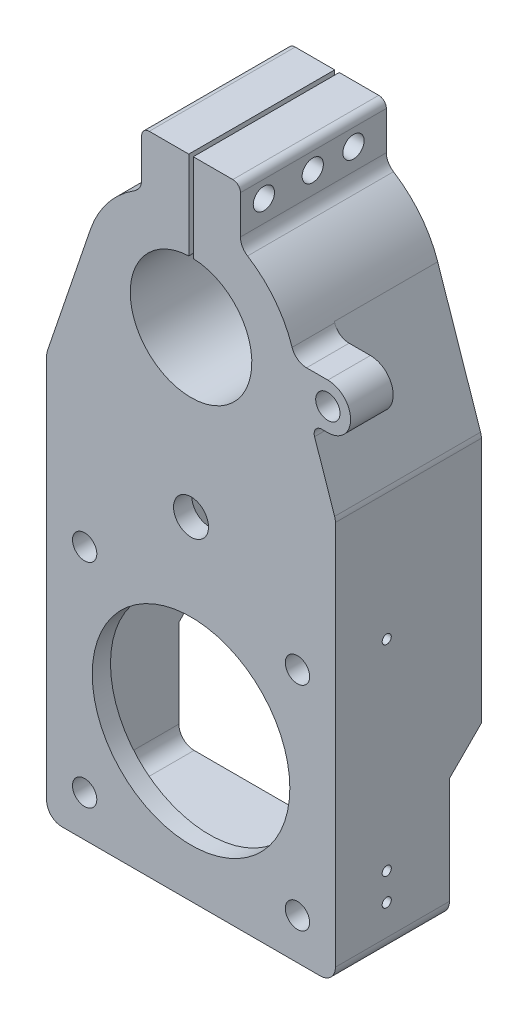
ISO-10303-21;
HEADER;
FILE_DESCRIPTION(('STEP AP214'),'2;1');
FILE_NAME('part.step','',(''),(''),'','','');
FILE_SCHEMA(('AUTOMOTIVE_DESIGN { 1 0 10303 214 1 1 1 1 }'));
ENDSEC;
DATA;
#1=APPLICATION_CONTEXT('core data for automotive mechanical design processes');
#2=APPLICATION_PROTOCOL_DEFINITION('international standard','automotive_design',2000,#1);
#3=PRODUCT_CONTEXT('',#1,'mechanical');
#4=PRODUCT('Part','Part','',(#3));
#5=PRODUCT_RELATED_PRODUCT_CATEGORY('part','',(#4));
#6=PRODUCT_DEFINITION_FORMATION('','',#4);
#7=PRODUCT_DEFINITION_CONTEXT('part definition',#1,'design');
#8=PRODUCT_DEFINITION('design','',#6,#7);
#9=PRODUCT_DEFINITION_SHAPE('','',#8);
#10=(LENGTH_UNIT() NAMED_UNIT(*) SI_UNIT(.MILLI.,.METRE.));
#11=(NAMED_UNIT(*) PLANE_ANGLE_UNIT() SI_UNIT($,.RADIAN.));
#12=(NAMED_UNIT(*) SI_UNIT($,.STERADIAN.) SOLID_ANGLE_UNIT());
#13=UNCERTAINTY_MEASURE_WITH_UNIT(LENGTH_MEASURE(1.E-05),#10,'distance_accuracy_value','');
#14=(GEOMETRIC_REPRESENTATION_CONTEXT(3) GLOBAL_UNCERTAINTY_ASSIGNED_CONTEXT((#13)) GLOBAL_UNIT_ASSIGNED_CONTEXT((#10,
#11,#12)) REPRESENTATION_CONTEXT('',''));
#15=CARTESIAN_POINT('',(0.,0.,0.));
#16=DIRECTION('',(0.,0.,1.));
#17=DIRECTION('',(1.,0.,0.));
#18=AXIS2_PLACEMENT_3D('',#15,#16,#17);
#19=CARTESIAN_POINT('',(0.,328.,28.));
#20=DIRECTION('',(0.,-1.,0.));
#21=DIRECTION('',(0.,0.,-1.));
#22=AXIS2_PLACEMENT_3D('',#19,#20,#21);
#23=PLANE('',#22);
#24=DIRECTION('',(-1.,0.,0.));
#25=VECTOR('',#24,1.);
#26=CARTESIAN_POINT('',(0.,328.,28.));
#27=LINE('',#26,#25);
#28=CARTESIAN_POINT('',(-1.5,328.,28.));
#29=VERTEX_POINT('',#28);
#30=CARTESIAN_POINT('',(-27.4999999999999,328.,28.));
#31=VERTEX_POINT('',#30);
#32=EDGE_CURVE('E470',#29,#31,#27,.T.);
#33=ORIENTED_EDGE('',*,*,#32,.F.);
#34=DIRECTION('',(0.,0.,1.));
#35=VECTOR('',#34,1.);
#36=CARTESIAN_POINT('',(-1.50000000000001,328.,-81.537045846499));
#37=LINE('',#36,#35);
#38=CARTESIAN_POINT('',(-1.50000000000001,328.,-68.));
#39=VERTEX_POINT('',#38);
#40=EDGE_CURVE('E609',#39,#29,#37,.T.);
#41=ORIENTED_EDGE('',*,*,#40,.F.);
#42=DIRECTION('',(1.,0.,0.));
#43=VECTOR('',#42,1.);
#44=CARTESIAN_POINT('',(27.5,328.,-68.));
#45=LINE('',#44,#43);
#46=CARTESIAN_POINT('',(-27.4999999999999,328.,-68.));
#47=VERTEX_POINT('',#46);
#48=EDGE_CURVE('E375',#47,#39,#45,.T.);
#49=ORIENTED_EDGE('',*,*,#48,.F.);
#50=DIRECTION('',(0.,0.,-1.));
#51=VECTOR('',#50,1.);
#52=CARTESIAN_POINT('',(-27.4999999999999,328.,28.));
#53=LINE('',#52,#51);
#54=EDGE_CURVE('E498',#31,#47,#53,.T.);
#55=ORIENTED_EDGE('',*,*,#54,.F.);
#56=EDGE_LOOP('',(#33,#41,#49,#55));
#57=FACE_BOUND('',#56,.T.);
#58=ADVANCED_FACE('F36',(#57),#23,.F.);
#59=CARTESIAN_POINT('',(0.,0.,28.));
#60=DIRECTION('',(0.,0.,-1.));
#61=DIRECTION('',(-1.,0.,0.));
#62=AXIS2_PLACEMENT_3D('',#59,#60,#61);
#63=CYLINDRICAL_SURFACE('',#62,65.);
#64=CARTESIAN_POINT('',(0.,0.,28.));
#65=DIRECTION('',(0.,0.,1.));
#66=DIRECTION('',(1.,0.,0.));
#67=AXIS2_PLACEMENT_3D('',#64,#65,#66);
#68=CIRCLE('',#67,65.);
#69=CARTESIAN_POINT('',(65.,0.,28.));
#70=VERTEX_POINT('',#69);
#71=EDGE_CURVE('E426',#70,#70,#68,.T.);
#72=ORIENTED_EDGE('',*,*,#71,.T.);
#73=EDGE_LOOP('',(#72));
#74=FACE_BOUND('',#73,.T.);
#75=CARTESIAN_POINT('',(0.,0.,16.));
#76=DIRECTION('',(0.,0.,-1.));
#77=DIRECTION('',(-1.,0.,0.));
#78=AXIS2_PLACEMENT_3D('',#75,#76,#77);
#79=CIRCLE('',#78,65.);
#80=CARTESIAN_POINT('',(-65.,0.,16.));
#81=VERTEX_POINT('',#80);
#82=EDGE_CURVE('E718',#81,#81,#79,.T.);
#83=ORIENTED_EDGE('',*,*,#82,.T.);
#84=EDGE_LOOP('',(#83));
#85=FACE_BOUND('',#84,.T.);
#86=ADVANCED_FACE('F832',(#74,#85),#63,.F.);
#87=CARTESIAN_POINT('',(-70.,-70.,28.));
#88=DIRECTION('',(0.,0.,-1.));
#89=DIRECTION('',(-1.,0.,0.));
#90=AXIS2_PLACEMENT_3D('',#87,#88,#89);
#91=CYLINDRICAL_SURFACE('',#90,8.);
#92=CARTESIAN_POINT('',(-70.,-70.,28.));
#93=DIRECTION('',(0.,0.,1.));
#94=DIRECTION('',(1.,0.,0.));
#95=AXIS2_PLACEMENT_3D('',#92,#93,#94);
#96=CIRCLE('',#95,8.);
#97=CARTESIAN_POINT('',(-62.,-70.,28.));
#98=VERTEX_POINT('',#97);
#99=EDGE_CURVE('E423',#98,#98,#96,.T.);
#100=ORIENTED_EDGE('',*,*,#99,.T.);
#101=EDGE_LOOP('',(#100));
#102=FACE_BOUND('',#101,.T.);
#103=CARTESIAN_POINT('',(-70.,-70.,16.));
#104=DIRECTION('',(0.,0.,-1.));
#105=DIRECTION('',(-1.,0.,0.));
#106=AXIS2_PLACEMENT_3D('',#103,#104,#105);
#107=CIRCLE('',#106,8.);
#108=CARTESIAN_POINT('',(-78.,-70.,16.));
#109=VERTEX_POINT('',#108);
#110=EDGE_CURVE('E716',#109,#109,#107,.T.);
#111=ORIENTED_EDGE('',*,*,#110,.T.);
#112=EDGE_LOOP('',(#111));
#113=FACE_BOUND('',#112,.T.);
#114=ADVANCED_FACE('F839',(#102,#113),#91,.F.);
#115=CARTESIAN_POINT('',(0.,122.,28.));
#116=DIRECTION('',(0.,0.,-1.));
#117=DIRECTION('',(-1.,0.,0.));
#118=AXIS2_PLACEMENT_3D('',#115,#116,#117);
#119=CYLINDRICAL_SURFACE('',#118,11.5);
#120=CARTESIAN_POINT('',(0.,122.,28.));
#121=DIRECTION('',(0.,0.,1.));
#122=DIRECTION('',(1.,0.,0.));
#123=AXIS2_PLACEMENT_3D('',#120,#121,#122);
#124=CIRCLE('',#123,11.5);
#125=CARTESIAN_POINT('',(11.5,122.,28.));
#126=VERTEX_POINT('',#125);
#127=EDGE_CURVE('E420',#126,#126,#124,.T.);
#128=ORIENTED_EDGE('',*,*,#127,.T.);
#129=EDGE_LOOP('',(#128));
#130=FACE_BOUND('',#129,.T.);
#131=CARTESIAN_POINT('',(0.,122.,16.));
#132=DIRECTION('',(0.,0.,-1.));
#133=DIRECTION('',(-1.,0.,0.));
#134=AXIS2_PLACEMENT_3D('',#131,#132,#133);
#135=CIRCLE('',#134,11.5);
#136=CARTESIAN_POINT('',(-11.5,122.,16.));
#137=VERTEX_POINT('',#136);
#138=EDGE_CURVE('E713',#137,#137,#135,.T.);
#139=ORIENTED_EDGE('',*,*,#138,.T.);
#140=EDGE_LOOP('',(#139));
#141=FACE_BOUND('',#140,.T.);
#142=ADVANCED_FACE('F985',(#130,#141),#119,.F.);
#143=CARTESIAN_POINT('',(-70.,70.,28.));
#144=DIRECTION('',(0.,0.,-1.));
#145=DIRECTION('',(-1.,0.,0.));
#146=AXIS2_PLACEMENT_3D('',#143,#144,#145);
#147=CYLINDRICAL_SURFACE('',#146,8.00000000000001);
#148=CARTESIAN_POINT('',(-70.,70.,28.));
#149=DIRECTION('',(0.,0.,1.));
#150=DIRECTION('',(-1.,0.,0.));
#151=AXIS2_PLACEMENT_3D('',#148,#149,#150);
#152=CIRCLE('',#151,8.00000000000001);
#153=CARTESIAN_POINT('',(-78.,70.,28.));
#154=VERTEX_POINT('',#153);
#155=EDGE_CURVE('E408',#154,#154,#152,.T.);
#156=ORIENTED_EDGE('',*,*,#155,.T.);
#157=EDGE_LOOP('',(#156));
#158=FACE_BOUND('',#157,.T.);
#159=CARTESIAN_POINT('',(-70.,70.,16.));
#160=DIRECTION('',(0.,0.,-1.));
#161=DIRECTION('',(-1.,0.,0.));
#162=AXIS2_PLACEMENT_3D('',#159,#160,#161);
#163=CIRCLE('',#162,8.00000000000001);
#164=CARTESIAN_POINT('',(-78.,70.,16.));
#165=VERTEX_POINT('',#164);
#166=EDGE_CURVE('E710',#165,#165,#163,.T.);
#167=ORIENTED_EDGE('',*,*,#166,.T.);
#168=EDGE_LOOP('',(#167));
#169=FACE_BOUND('',#168,.T.);
#170=ADVANCED_FACE('F989',(#158,#169),#147,.F.);
#171=CARTESIAN_POINT('',(70.,-70.,28.));
#172=DIRECTION('',(0.,0.,-1.));
#173=DIRECTION('',(-1.,0.,0.));
#174=AXIS2_PLACEMENT_3D('',#171,#172,#173);
#175=CYLINDRICAL_SURFACE('',#174,8.);
#176=CARTESIAN_POINT('',(70.,-70.,28.));
#177=DIRECTION('',(0.,0.,1.));
#178=DIRECTION('',(-1.,0.,0.));
#179=AXIS2_PLACEMENT_3D('',#176,#177,#178);
#180=CIRCLE('',#179,8.);
#181=CARTESIAN_POINT('',(62.,-70.,28.));
#182=VERTEX_POINT('',#181);
#183=EDGE_CURVE('E405',#182,#182,#180,.T.);
#184=ORIENTED_EDGE('',*,*,#183,.T.);
#185=EDGE_LOOP('',(#184));
#186=FACE_BOUND('',#185,.T.);
#187=CARTESIAN_POINT('',(70.,-70.,16.));
#188=DIRECTION('',(0.,0.,-1.));
#189=DIRECTION('',(-1.,0.,0.));
#190=AXIS2_PLACEMENT_3D('',#187,#188,#189);
#191=CIRCLE('',#190,8.);
#192=CARTESIAN_POINT('',(62.,-70.,16.));
#193=VERTEX_POINT('',#192);
#194=EDGE_CURVE('E552',#193,#193,#191,.T.);
#195=ORIENTED_EDGE('',*,*,#194,.T.);
#196=EDGE_LOOP('',(#195));
#197=FACE_BOUND('',#196,.T.);
#198=ADVANCED_FACE('F999',(#186,#197),#175,.F.);
#199=CARTESIAN_POINT('',(70.,69.9999999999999,28.));
#200=DIRECTION('',(0.,0.,-1.));
#201=DIRECTION('',(-1.,0.,0.));
#202=AXIS2_PLACEMENT_3D('',#199,#200,#201);
#203=CYLINDRICAL_SURFACE('',#202,8.00000000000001);
#204=CARTESIAN_POINT('',(70.,69.9999999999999,28.));
#205=DIRECTION('',(0.,0.,1.));
#206=DIRECTION('',(1.,0.,0.));
#207=AXIS2_PLACEMENT_3D('',#204,#205,#206);
#208=CIRCLE('',#207,8.00000000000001);
#209=CARTESIAN_POINT('',(78.,69.9999999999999,28.));
#210=VERTEX_POINT('',#209);
#211=EDGE_CURVE('E402',#210,#210,#208,.T.);
#212=ORIENTED_EDGE('',*,*,#211,.T.);
#213=EDGE_LOOP('',(#212));
#214=FACE_BOUND('',#213,.T.);
#215=CARTESIAN_POINT('',(70.,69.9999999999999,16.));
#216=DIRECTION('',(0.,0.,-1.));
#217=DIRECTION('',(-1.,0.,0.));
#218=AXIS2_PLACEMENT_3D('',#215,#216,#217);
#219=CIRCLE('',#218,8.00000000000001);
#220=CARTESIAN_POINT('',(62.,69.9999999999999,16.));
#221=VERTEX_POINT('',#220);
#222=EDGE_CURVE('E549',#221,#221,#219,.T.);
#223=ORIENTED_EDGE('',*,*,#222,.T.);
#224=EDGE_LOOP('',(#223));
#225=FACE_BOUND('',#224,.T.);
#226=ADVANCED_FACE('F1003',(#214,#225),#203,.F.);
#227=CARTESIAN_POINT('',(85.,-87.,-68.));
#228=DIRECTION('',(0.,0.,-1.));
#229=DIRECTION('',(-1.,0.,0.));
#230=AXIS2_PLACEMENT_3D('',#227,#228,#229);
#231=PLANE('',#230);
#232=DIRECTION('',(1.,0.,0.));
#233=VECTOR('',#232,1.);
#234=CARTESIAN_POINT('',(-95.,4.00000000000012,-68.));
#235=LINE('',#234,#233);
#236=CARTESIAN_POINT('',(-95.,4.00000000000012,-68.));
#237=VERTEX_POINT('',#236);
#238=CARTESIAN_POINT('',(-83.,4.00000000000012,-68.));
#239=VERTEX_POINT('',#238);
#240=EDGE_CURVE('E322',#237,#239,#235,.T.);
#241=ORIENTED_EDGE('',*,*,#240,.F.);
#242=DIRECTION('',(0.,1.,0.));
#243=VECTOR('',#242,1.);
#244=CARTESIAN_POINT('',(-95.,166.347317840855,-68.));
#245=LINE('',#244,#243);
#246=CARTESIAN_POINT('',(-95.,166.347317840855,-68.));
#247=VERTEX_POINT('',#246);
#248=EDGE_CURVE('E337',#237,#247,#245,.T.);
#249=ORIENTED_EDGE('',*,*,#248,.T.);
#250=CARTESIAN_POINT('',(-85.,166.347317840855,-68.));
#251=DIRECTION('',(0.,0.,-1.));
#252=DIRECTION('',(-1.,0.,0.));
#253=AXIS2_PLACEMENT_3D('',#250,#251,#252);
#254=CIRCLE('',#253,10.);
#255=CARTESIAN_POINT('',(-94.4682522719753,169.564801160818,-68.));
#256=VERTEX_POINT('',#255);
#257=EDGE_CURVE('E348',#247,#256,#254,.T.);
#258=ORIENTED_EDGE('',*,*,#257,.T.);
#259=DIRECTION('',(0.321748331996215,0.94682522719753,0.));
#260=VECTOR('',#259,1.);
#261=CARTESIAN_POINT('',(-66.2777659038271,252.522383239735,-68.));
#262=LINE('',#261,#260);
#263=CARTESIAN_POINT('',(-66.2777659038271,252.522383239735,-68.));
#264=VERTEX_POINT('',#263);
#265=EDGE_CURVE('E351',#256,#264,#262,.T.);
#266=ORIENTED_EDGE('',*,*,#265,.T.);
#267=CARTESIAN_POINT('',(0.,230.,-68.));
#268=DIRECTION('',(0.,0.,-1.));
#269=DIRECTION('',(-1.,0.,0.));
#270=AXIS2_PLACEMENT_3D('',#267,#268,#269);
#271=CIRCLE('',#270,70.);
#272=CARTESIAN_POINT('',(-37.1874999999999,289.305057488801,-68.));
#273=VERTEX_POINT('',#272);
#274=EDGE_CURVE('E362',#264,#273,#271,.T.);
#275=ORIENTED_EDGE('',*,*,#274,.T.);
#276=CARTESIAN_POINT('',(-42.4999999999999,297.77720855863,-68.));
#277=DIRECTION('',(0.,0.,1.));
#278=DIRECTION('',(-1.,0.,0.));
#279=AXIS2_PLACEMENT_3D('',#276,#277,#278);
#280=CIRCLE('',#279,10.);
#281=CARTESIAN_POINT('',(-32.4999999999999,297.77720855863,-68.));
#282=VERTEX_POINT('',#281);
#283=EDGE_CURVE('E365',#273,#282,#280,.T.);
#284=ORIENTED_EDGE('',*,*,#283,.T.);
#285=DIRECTION('',(0.,1.,0.));
#286=VECTOR('',#285,1.);
#287=CARTESIAN_POINT('',(-32.5,323.,-68.));
#288=LINE('',#287,#286);
#289=CARTESIAN_POINT('',(-32.5,323.,-68.));
#290=VERTEX_POINT('',#289);
#291=EDGE_CURVE('E368',#282,#290,#288,.T.);
#292=ORIENTED_EDGE('',*,*,#291,.T.);
#293=CARTESIAN_POINT('',(-27.5,323.,-68.));
#294=DIRECTION('',(0.,0.,-1.));
#295=DIRECTION('',(-1.,0.,0.));
#296=AXIS2_PLACEMENT_3D('',#293,#294,#295);
#297=CIRCLE('',#296,5.);
#298=EDGE_CURVE('E371',#290,#47,#297,.T.);
#299=ORIENTED_EDGE('',*,*,#298,.T.);
#300=ORIENTED_EDGE('',*,*,#48,.T.);
#301=DIRECTION('',(0.,1.,0.));
#302=VECTOR('',#301,1.);
#303=CARTESIAN_POINT('',(-1.50000000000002,-87.,-68.));
#304=LINE('',#303,#302);
#305=CARTESIAN_POINT('',(-1.5,269.971865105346,-68.));
#306=VERTEX_POINT('',#305);
#307=EDGE_CURVE('E620',#306,#39,#304,.T.);
#308=ORIENTED_EDGE('',*,*,#307,.F.);
#309=CARTESIAN_POINT('',(0.,230.,-68.));
#310=DIRECTION('',(0.,0.,-1.));
#311=DIRECTION('',(-1.,0.,0.));
#312=AXIS2_PLACEMENT_3D('',#309,#310,#311);
#313=CIRCLE('',#312,40.);
#314=CARTESIAN_POINT('',(1.5,269.971865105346,-68.));
#315=VERTEX_POINT('',#314);
#316=EDGE_CURVE('E357',#315,#306,#313,.T.);
#317=ORIENTED_EDGE('',*,*,#316,.F.);
#318=DIRECTION('',(0.,-1.,0.));
#319=VECTOR('',#318,1.);
#320=CARTESIAN_POINT('',(1.49999999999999,-87.,-68.));
#321=LINE('',#320,#319);
#322=CARTESIAN_POINT('',(1.49999999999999,328.,-68.));
#323=VERTEX_POINT('',#322);
#324=EDGE_CURVE('E59',#323,#315,#321,.T.);
#325=ORIENTED_EDGE('',*,*,#324,.F.);
#326=CARTESIAN_POINT('',(27.5,328.,-68.));
#327=VERTEX_POINT('',#326);
#328=EDGE_CURVE('E374',#323,#327,#45,.T.);
#329=ORIENTED_EDGE('',*,*,#328,.T.);
#330=CARTESIAN_POINT('',(27.5,323.,-68.));
#331=DIRECTION('',(0.,0.,-1.));
#332=DIRECTION('',(-1.,0.,0.));
#333=AXIS2_PLACEMENT_3D('',#330,#331,#332);
#334=CIRCLE('',#333,5.);
#335=CARTESIAN_POINT('',(32.5,323.,-68.));
#336=VERTEX_POINT('',#335);
#337=EDGE_CURVE('E378',#327,#336,#334,.T.);
#338=ORIENTED_EDGE('',*,*,#337,.T.);
#339=DIRECTION('',(0.,-1.,0.));
#340=VECTOR('',#339,1.);
#341=CARTESIAN_POINT('',(32.5000000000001,297.77720855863,-68.));
#342=LINE('',#341,#340);
#343=CARTESIAN_POINT('',(32.5000000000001,297.77720855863,-68.));
#344=VERTEX_POINT('',#343);
#345=EDGE_CURVE('E381',#336,#344,#342,.T.);
#346=ORIENTED_EDGE('',*,*,#345,.T.);
#347=CARTESIAN_POINT('',(42.5000000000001,297.77720855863,-68.));
#348=DIRECTION('',(0.,0.,1.));
#349=DIRECTION('',(-1.,0.,0.));
#350=AXIS2_PLACEMENT_3D('',#347,#348,#349);
#351=CIRCLE('',#350,10.);
#352=CARTESIAN_POINT('',(37.1875000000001,289.305057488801,-68.));
#353=VERTEX_POINT('',#352);
#354=EDGE_CURVE('E384',#344,#353,#351,.T.);
#355=ORIENTED_EDGE('',*,*,#354,.T.);
#356=CARTESIAN_POINT('',(0.,230.,-68.));
#357=DIRECTION('',(0.,0.,-1.));
#358=DIRECTION('',(1.,0.,0.));
#359=AXIS2_PLACEMENT_3D('',#356,#357,#358);
#360=CIRCLE('',#359,70.);
#361=CARTESIAN_POINT('',(66.2777659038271,252.522383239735,-68.));
#362=VERTEX_POINT('',#361);
#363=EDGE_CURVE('E387',#353,#362,#360,.T.);
#364=ORIENTED_EDGE('',*,*,#363,.T.);
#365=DIRECTION('',(0.321748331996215,-0.94682522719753,0.));
#366=VECTOR('',#365,1.);
#367=CARTESIAN_POINT('',(66.2777659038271,252.522383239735,-68.));
#368=LINE('',#367,#366);
#369=CARTESIAN_POINT('',(94.4682522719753,169.564801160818,-68.));
#370=VERTEX_POINT('',#369);
#371=EDGE_CURVE('E389',#362,#370,#368,.T.);
#372=ORIENTED_EDGE('',*,*,#371,.T.);
#373=CARTESIAN_POINT('',(85.,166.347317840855,-68.));
#374=DIRECTION('',(0.,0.,-1.));
#375=DIRECTION('',(1.,0.,0.));
#376=AXIS2_PLACEMENT_3D('',#373,#374,#375);
#377=CIRCLE('',#376,10.);
#378=CARTESIAN_POINT('',(95.,166.347317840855,-68.));
#379=VERTEX_POINT('',#378);
#380=EDGE_CURVE('E392',#370,#379,#377,.T.);
#381=ORIENTED_EDGE('',*,*,#380,.T.);
#382=DIRECTION('',(0.,-1.,0.));
#383=VECTOR('',#382,1.);
#384=CARTESIAN_POINT('',(95.,166.347317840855,-68.));
#385=LINE('',#384,#383);
#386=CARTESIAN_POINT('',(95.,4.00000000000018,-68.));
#387=VERTEX_POINT('',#386);
#388=EDGE_CURVE('E395',#379,#387,#385,.T.);
#389=ORIENTED_EDGE('',*,*,#388,.T.);
#390=CARTESIAN_POINT('',(83.,4.00000000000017,-68.));
#391=VERTEX_POINT('',#390);
#392=EDGE_CURVE('E341',#391,#387,#235,.T.);
#393=ORIENTED_EDGE('',*,*,#392,.F.);
#394=DIRECTION('',(0.,-1.,0.));
#395=VECTOR('',#394,1.);
#396=CARTESIAN_POINT('',(83.,-75.,-68.));
#397=LINE('',#396,#395);
#398=CARTESIAN_POINT('',(83.,172.557094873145,-68.));
#399=VERTEX_POINT('',#398);
#400=EDGE_CURVE('E562',#399,#391,#397,.T.);
#401=ORIENTED_EDGE('',*,*,#400,.F.);
#402=CARTESIAN_POINT('',(68.,172.557094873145,-68.));
#403=DIRECTION('',(0.,0.,-1.));
#404=DIRECTION('',(-1.,0.,0.));
#405=AXIS2_PLACEMENT_3D('',#402,#403,#404);
#406=CIRCLE('',#405,15.);
#407=CARTESIAN_POINT('',(82.224854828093,177.316664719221,-68.));
#408=VERTEX_POINT('',#407);
#409=EDGE_CURVE('E671',#408,#399,#406,.T.);
#410=ORIENTED_EDGE('',*,*,#409,.F.);
#411=DIRECTION('',(0.317304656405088,-0.948323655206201,0.));
#412=VECTOR('',#411,1.);
#413=CARTESIAN_POINT('',(82.224854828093,177.316664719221,-68.));
#414=LINE('',#413,#412);
#415=CARTESIAN_POINT('',(80.7204086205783,181.812980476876,-68.));
#416=VERTEX_POINT('',#415);
#417=EDGE_CURVE('E668',#416,#408,#414,.T.);
#418=ORIENTED_EDGE('',*,*,#417,.F.);
#419=CARTESIAN_POINT('',(66.4955537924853,177.0534106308,-68.));
#420=DIRECTION('',(0.,0.,-1.));
#421=DIRECTION('',(-1.,0.,0.));
#422=AXIS2_PLACEMENT_3D('',#419,#420,#421);
#423=CIRCLE('',#422,15.);
#424=CARTESIAN_POINT('',(54.7610442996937,186.396926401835,-68.));
#425=VERTEX_POINT('',#424);
#426=EDGE_CURVE('E665',#425,#416,#423,.T.);
#427=ORIENTED_EDGE('',*,*,#426,.F.);
#428=CARTESIAN_POINT('',(0.,230.,-68.));
#429=DIRECTION('',(0.,0.,1.));
#430=DIRECTION('',(-1.,0.,0.));
#431=AXIS2_PLACEMENT_3D('',#428,#429,#430);
#432=CIRCLE('',#431,70.);
#433=CARTESIAN_POINT('',(-54.7610442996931,186.396926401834,-68.));
#434=VERTEX_POINT('',#433);
#435=EDGE_CURVE('E662',#434,#425,#432,.T.);
#436=ORIENTED_EDGE('',*,*,#435,.F.);
#437=CARTESIAN_POINT('',(-66.4955537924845,177.053410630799,-68.));
#438=DIRECTION('',(0.,0.,-1.));
#439=DIRECTION('',(-1.,0.,0.));
#440=AXIS2_PLACEMENT_3D('',#437,#438,#439);
#441=CIRCLE('',#440,15.);
#442=CARTESIAN_POINT('',(-80.7204086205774,181.812980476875,-68.));
#443=VERTEX_POINT('',#442);
#444=EDGE_CURVE('E622',#443,#434,#441,.T.);
#445=ORIENTED_EDGE('',*,*,#444,.F.);
#446=DIRECTION('',(0.317304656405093,0.948323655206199,0.));
#447=VECTOR('',#446,1.);
#448=CARTESIAN_POINT('',(-82.2248548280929,177.316664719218,-68.));
#449=LINE('',#448,#447);
#450=CARTESIAN_POINT('',(-82.2248548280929,177.316664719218,-68.));
#451=VERTEX_POINT('',#450);
#452=EDGE_CURVE('E627',#451,#443,#449,.T.);
#453=ORIENTED_EDGE('',*,*,#452,.F.);
#454=CARTESIAN_POINT('',(-68.,172.557094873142,-68.));
#455=DIRECTION('',(0.,0.,-1.));
#456=DIRECTION('',(1.,0.,0.));
#457=AXIS2_PLACEMENT_3D('',#454,#455,#456);
#458=CIRCLE('',#457,15.);
#459=CARTESIAN_POINT('',(-83.,172.557094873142,-68.));
#460=VERTEX_POINT('',#459);
#461=EDGE_CURVE('E676',#460,#451,#458,.T.);
#462=ORIENTED_EDGE('',*,*,#461,.F.);
#463=DIRECTION('',(0.,1.,0.));
#464=VECTOR('',#463,1.);
#465=CARTESIAN_POINT('',(-83.,172.557094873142,-68.));
#466=LINE('',#465,#464);
#467=EDGE_CURVE('E340',#239,#460,#466,.T.);
#468=ORIENTED_EDGE('',*,*,#467,.F.);
#469=EDGE_LOOP('',(#241,#249,#258,#266,#275,#284,#292,#299,#300,#308,#317,#325,#329,#338,#346,
#355,#364,#372,#381,#389,#393,#401,#410,#418,#427,#436,#445,#453,#462,#468));
#470=FACE_BOUND('',#469,.T.);
#471=ADVANCED_FACE('F335',(#470),#231,.T.);
#472=CARTESIAN_POINT('',(0.,230.,0.));
#473=DIRECTION('',(0.,0.,1.));
#474=DIRECTION('',(1.,0.,0.));
#475=AXIS2_PLACEMENT_3D('',#472,#473,#474);
#476=PLANE('',#475);
#477=CARTESIAN_POINT('',(90.,230.,0.));
#478=DIRECTION('',(0.,0.,1.));
#479=DIRECTION('',(1.,0.,0.));
#480=AXIS2_PLACEMENT_3D('',#477,#478,#479);
#481=CIRCLE('',#480,8.00000000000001);
#482=CARTESIAN_POINT('',(98.,230.,0.));
#483=VERTEX_POINT('',#482);
#484=EDGE_CURVE('E411',#483,#483,#481,.T.);
#485=ORIENTED_EDGE('',*,*,#484,.T.);
#486=EDGE_LOOP('',(#485));
#487=FACE_BOUND('',#486,.T.);
#488=DIRECTION('',(0.321748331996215,-0.94682522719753,0.));
#489=VECTOR('',#488,1.);
#490=CARTESIAN_POINT('',(66.2777659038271,252.522383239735,0.));
#491=LINE('',#490,#489);
#492=CARTESIAN_POINT('',(66.6175060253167,251.522612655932,0.));
#493=VERTEX_POINT('',#492);
#494=CARTESIAN_POINT('',(81.2743200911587,208.391258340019,0.));
#495=VERTEX_POINT('',#494);
#496=EDGE_CURVE('E354',#493,#495,#491,.T.);
#497=ORIENTED_EDGE('',*,*,#496,.F.);
#498=CARTESIAN_POINT('',(75.9934207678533,255.,0.));
#499=DIRECTION('',(0.,0.,-1.));
#500=DIRECTION('',(1.,0.,0.));
#501=AXIS2_PLACEMENT_3D('',#498,#499,#500);
#502=CIRCLE('',#501,10.);
#503=CARTESIAN_POINT('',(75.9934207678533,245.,0.));
#504=VERTEX_POINT('',#503);
#505=EDGE_CURVE('E488',#504,#493,#502,.T.);
#506=ORIENTED_EDGE('',*,*,#505,.F.);
#507=DIRECTION('',(-1.,0.,0.));
#508=VECTOR('',#507,1.);
#509=CARTESIAN_POINT('',(90.,245.,0.));
#510=LINE('',#509,#508);
#511=CARTESIAN_POINT('',(90.,245.,0.));
#512=VERTEX_POINT('',#511);
#513=EDGE_CURVE('E486',#512,#504,#510,.T.);
#514=ORIENTED_EDGE('',*,*,#513,.F.);
#515=CARTESIAN_POINT('',(90.,230.,0.));
#516=DIRECTION('',(0.,0.,1.));
#517=DIRECTION('',(1.,0.,0.));
#518=AXIS2_PLACEMENT_3D('',#515,#516,#517);
#519=CIRCLE('',#518,15.);
#520=CARTESIAN_POINT('',(90.,215.,0.));
#521=VERTEX_POINT('',#520);
#522=EDGE_CURVE('E484',#521,#512,#519,.T.);
#523=ORIENTED_EDGE('',*,*,#522,.F.);
#524=DIRECTION('',(1.,0.,0.));
#525=VECTOR('',#524,1.);
#526=CARTESIAN_POINT('',(90.,215.,0.));
#527=LINE('',#526,#525);
#528=CARTESIAN_POINT('',(86.0084462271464,215.,0.));
#529=VERTEX_POINT('',#528);
#530=EDGE_CURVE('E482',#529,#521,#527,.T.);
#531=ORIENTED_EDGE('',*,*,#530,.F.);
#532=CARTESIAN_POINT('',(86.0084462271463,210.,0.));
#533=DIRECTION('',(0.,0.,-1.));
#534=DIRECTION('',(1.,0.,0.));
#535=AXIS2_PLACEMENT_3D('',#532,#533,#534);
#536=CIRCLE('',#535,5.);
#537=EDGE_CURVE('E429',#495,#529,#536,.T.);
#538=ORIENTED_EDGE('',*,*,#537,.F.);
#539=EDGE_LOOP('',(#497,#506,#514,#523,#531,#538));
#540=FACE_BOUND('',#539,.T.);
#541=ADVANCED_FACE('F740',(#487,#540),#476,.F.);
#542=CARTESIAN_POINT('',(0.,230.,28.));
#543=DIRECTION('',(0.,0.,1.));
#544=DIRECTION('',(1.,0.,0.));
#545=AXIS2_PLACEMENT_3D('',#542,#543,#544);
#546=PLANE('',#545);
#547=DIRECTION('',(0.,-1.,0.));
#548=VECTOR('',#547,1.);
#549=CARTESIAN_POINT('',(-1.5,230.,28.));
#550=LINE('',#549,#548);
#551=CARTESIAN_POINT('',(-1.5,269.971865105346,28.));
#552=VERTEX_POINT('',#551);
#553=EDGE_CURVE('E618',#29,#552,#550,.T.);
#554=ORIENTED_EDGE('',*,*,#553,.F.);
#555=ORIENTED_EDGE('',*,*,#32,.T.);
#556=CARTESIAN_POINT('',(-27.5,323.,28.));
#557=DIRECTION('',(0.,0.,1.));
#558=DIRECTION('',(1.,0.,0.));
#559=AXIS2_PLACEMENT_3D('',#556,#557,#558);
#560=CIRCLE('',#559,5.);
#561=CARTESIAN_POINT('',(-32.5,323.,28.));
#562=VERTEX_POINT('',#561);
#563=EDGE_CURVE('E474',#31,#562,#560,.T.);
#564=ORIENTED_EDGE('',*,*,#563,.T.);
#565=DIRECTION('',(0.,-1.,0.));
#566=VECTOR('',#565,1.);
#567=CARTESIAN_POINT('',(-32.5,323.,28.));
#568=LINE('',#567,#566);
#569=CARTESIAN_POINT('',(-32.4999999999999,297.77720855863,28.));
#570=VERTEX_POINT('',#569);
#571=EDGE_CURVE('E476',#562,#570,#568,.T.);
#572=ORIENTED_EDGE('',*,*,#571,.T.);
#573=CARTESIAN_POINT('',(-42.4999999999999,297.77720855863,28.));
#574=DIRECTION('',(0.,0.,-1.));
#575=DIRECTION('',(-1.,0.,0.));
#576=AXIS2_PLACEMENT_3D('',#573,#574,#575);
#577=CIRCLE('',#576,10.);
#578=CARTESIAN_POINT('',(-37.1874999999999,289.305057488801,28.));
#579=VERTEX_POINT('',#578);
#580=EDGE_CURVE('E478',#570,#579,#577,.T.);
#581=ORIENTED_EDGE('',*,*,#580,.T.);
#582=CARTESIAN_POINT('',(0.,230.,28.));
#583=DIRECTION('',(0.,0.,1.));
#584=DIRECTION('',(1.,0.,0.));
#585=AXIS2_PLACEMENT_3D('',#582,#583,#584);
#586=CIRCLE('',#585,70.);
#587=CARTESIAN_POINT('',(-66.2777659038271,252.522383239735,28.));
#588=VERTEX_POINT('',#587);
#589=EDGE_CURVE('E430',#579,#588,#586,.T.);
#590=ORIENTED_EDGE('',*,*,#589,.T.);
#591=DIRECTION('',(-0.321748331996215,-0.94682522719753,0.));
#592=VECTOR('',#591,1.);
#593=CARTESIAN_POINT('',(-94.4682522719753,169.564801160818,28.));
#594=LINE('',#593,#592);
#595=CARTESIAN_POINT('',(-94.4682522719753,169.564801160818,28.));
#596=VERTEX_POINT('',#595);
#597=EDGE_CURVE('E433',#588,#596,#594,.T.);
#598=ORIENTED_EDGE('',*,*,#597,.T.);
#599=CARTESIAN_POINT('',(-85.,166.347317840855,28.));
#600=DIRECTION('',(0.,0.,1.));
#601=DIRECTION('',(1.,0.,0.));
#602=AXIS2_PLACEMENT_3D('',#599,#600,#601);
#603=CIRCLE('',#602,10.);
#604=CARTESIAN_POINT('',(-95.,166.347317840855,28.));
#605=VERTEX_POINT('',#604);
#606=EDGE_CURVE('E436',#596,#605,#603,.T.);
#607=ORIENTED_EDGE('',*,*,#606,.T.);
#608=DIRECTION('',(0.,-1.,0.));
#609=VECTOR('',#608,1.);
#610=CARTESIAN_POINT('',(-95.,-87.,28.));
#611=LINE('',#610,#609);
#612=CARTESIAN_POINT('',(-95.,-87.,28.));
#613=VERTEX_POINT('',#612);
#614=EDGE_CURVE('E438',#605,#613,#611,.T.);
#615=ORIENTED_EDGE('',*,*,#614,.T.);
#616=CARTESIAN_POINT('',(-85.,-87.,28.));
#617=DIRECTION('',(0.,0.,1.));
#618=DIRECTION('',(1.,0.,0.));
#619=AXIS2_PLACEMENT_3D('',#616,#617,#618);
#620=CIRCLE('',#619,10.);
#621=CARTESIAN_POINT('',(-84.9999999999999,-97.,28.));
#622=VERTEX_POINT('',#621);
#623=EDGE_CURVE('E440',#613,#622,#620,.T.);
#624=ORIENTED_EDGE('',*,*,#623,.T.);
#625=DIRECTION('',(1.,0.,0.));
#626=VECTOR('',#625,1.);
#627=CARTESIAN_POINT('',(85.,-97.,28.));
#628=LINE('',#627,#626);
#629=CARTESIAN_POINT('',(85.,-97.,28.));
#630=VERTEX_POINT('',#629);
#631=EDGE_CURVE('E442',#622,#630,#628,.T.);
#632=ORIENTED_EDGE('',*,*,#631,.T.);
#633=CARTESIAN_POINT('',(85.,-87.,28.));
#634=DIRECTION('',(0.,0.,1.));
#635=DIRECTION('',(-1.,0.,0.));
#636=AXIS2_PLACEMENT_3D('',#633,#634,#635);
#637=CIRCLE('',#636,10.);
#638=CARTESIAN_POINT('',(95.,-86.9999999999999,28.));
#639=VERTEX_POINT('',#638);
#640=EDGE_CURVE('E444',#630,#639,#637,.T.);
#641=ORIENTED_EDGE('',*,*,#640,.T.);
#642=DIRECTION('',(0.,1.,0.));
#643=VECTOR('',#642,1.);
#644=CARTESIAN_POINT('',(94.9999999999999,166.347317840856,28.));
#645=LINE('',#644,#643);
#646=CARTESIAN_POINT('',(94.9999999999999,166.347317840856,28.));
#647=VERTEX_POINT('',#646);
#648=EDGE_CURVE('E446',#639,#647,#645,.T.);
#649=ORIENTED_EDGE('',*,*,#648,.T.);
#650=CARTESIAN_POINT('',(85.,166.347317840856,28.));
#651=DIRECTION('',(0.,0.,1.));
#652=DIRECTION('',(-1.,0.,0.));
#653=AXIS2_PLACEMENT_3D('',#650,#651,#652);
#654=CIRCLE('',#653,10.);
#655=CARTESIAN_POINT('',(94.4682522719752,169.564801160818,28.));
#656=VERTEX_POINT('',#655);
#657=EDGE_CURVE('E448',#647,#656,#654,.T.);
#658=ORIENTED_EDGE('',*,*,#657,.T.);
#659=DIRECTION('',(-0.321748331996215,0.946825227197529,0.));
#660=VECTOR('',#659,1.);
#661=CARTESIAN_POINT('',(94.4682522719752,169.564801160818,28.));
#662=LINE('',#661,#660);
#663=CARTESIAN_POINT('',(81.2743200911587,208.391258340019,28.));
#664=VERTEX_POINT('',#663);
#665=EDGE_CURVE('E450',#656,#664,#662,.T.);
#666=ORIENTED_EDGE('',*,*,#665,.T.);
#667=CARTESIAN_POINT('',(86.0084462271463,210.,28.));
#668=DIRECTION('',(0.,0.,-1.));
#669=DIRECTION('',(1.,0.,0.));
#670=AXIS2_PLACEMENT_3D('',#667,#668,#669);
#671=CIRCLE('',#670,5.);
#672=CARTESIAN_POINT('',(86.0084462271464,215.,28.));
#673=VERTEX_POINT('',#672);
#674=EDGE_CURVE('E452',#664,#673,#671,.T.);
#675=ORIENTED_EDGE('',*,*,#674,.T.);
#676=DIRECTION('',(1.,0.,0.));
#677=VECTOR('',#676,1.);
#678=CARTESIAN_POINT('',(90.,215.,28.));
#679=LINE('',#678,#677);
#680=CARTESIAN_POINT('',(90.,215.,28.));
#681=VERTEX_POINT('',#680);
#682=EDGE_CURVE('E454',#673,#681,#679,.T.);
#683=ORIENTED_EDGE('',*,*,#682,.T.);
#684=CARTESIAN_POINT('',(90.,230.,28.));
#685=DIRECTION('',(0.,0.,1.));
#686=DIRECTION('',(1.,0.,0.));
#687=AXIS2_PLACEMENT_3D('',#684,#685,#686);
#688=CIRCLE('',#687,15.);
#689=CARTESIAN_POINT('',(90.,245.,28.));
#690=VERTEX_POINT('',#689);
#691=EDGE_CURVE('E456',#681,#690,#688,.T.);
#692=ORIENTED_EDGE('',*,*,#691,.T.);
#693=DIRECTION('',(-1.,0.,0.));
#694=VECTOR('',#693,1.);
#695=CARTESIAN_POINT('',(90.,245.,28.));
#696=LINE('',#695,#694);
#697=CARTESIAN_POINT('',(75.9934207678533,245.,28.));
#698=VERTEX_POINT('',#697);
#699=EDGE_CURVE('E458',#690,#698,#696,.T.);
#700=ORIENTED_EDGE('',*,*,#699,.T.);
#701=CARTESIAN_POINT('',(75.9934207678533,255.,28.));
#702=DIRECTION('',(0.,0.,-1.));
#703=DIRECTION('',(1.,0.,0.));
#704=AXIS2_PLACEMENT_3D('',#701,#702,#703);
#705=CIRCLE('',#704,10.);
#706=CARTESIAN_POINT('',(66.4942431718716,251.875,28.));
#707=VERTEX_POINT('',#706);
#708=EDGE_CURVE('E460',#698,#707,#705,.T.);
#709=ORIENTED_EDGE('',*,*,#708,.T.);
#710=CARTESIAN_POINT('',(0.,230.,28.));
#711=DIRECTION('',(0.,0.,1.));
#712=DIRECTION('',(1.,0.,0.));
#713=AXIS2_PLACEMENT_3D('',#710,#711,#712);
#714=CIRCLE('',#713,70.);
#715=CARTESIAN_POINT('',(37.1875000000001,289.305057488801,28.));
#716=VERTEX_POINT('',#715);
#717=EDGE_CURVE('E462',#707,#716,#714,.T.);
#718=ORIENTED_EDGE('',*,*,#717,.T.);
#719=CARTESIAN_POINT('',(42.5000000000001,297.77720855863,28.));
#720=DIRECTION('',(0.,0.,-1.));
#721=DIRECTION('',(1.,0.,0.));
#722=AXIS2_PLACEMENT_3D('',#719,#720,#721);
#723=CIRCLE('',#722,10.);
#724=CARTESIAN_POINT('',(32.5000000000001,297.77720855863,28.));
#725=VERTEX_POINT('',#724);
#726=EDGE_CURVE('E464',#716,#725,#723,.T.);
#727=ORIENTED_EDGE('',*,*,#726,.T.);
#728=DIRECTION('',(0.,1.,0.));
#729=VECTOR('',#728,1.);
#730=CARTESIAN_POINT('',(32.5,323.,28.));
#731=LINE('',#730,#729);
#732=CARTESIAN_POINT('',(32.5,323.,28.));
#733=VERTEX_POINT('',#732);
#734=EDGE_CURVE('E466',#725,#733,#731,.T.);
#735=ORIENTED_EDGE('',*,*,#734,.T.);
#736=CARTESIAN_POINT('',(27.5,323.,28.));
#737=DIRECTION('',(0.,0.,1.));
#738=DIRECTION('',(-1.,0.,0.));
#739=AXIS2_PLACEMENT_3D('',#736,#737,#738);
#740=CIRCLE('',#739,5.);
#741=CARTESIAN_POINT('',(27.5,328.,28.));
#742=VERTEX_POINT('',#741);
#743=EDGE_CURVE('E468',#733,#742,#740,.T.);
#744=ORIENTED_EDGE('',*,*,#743,.T.);
#745=CARTESIAN_POINT('',(1.5,328.,28.));
#746=VERTEX_POINT('',#745);
#747=EDGE_CURVE('E471',#742,#746,#27,.T.);
#748=ORIENTED_EDGE('',*,*,#747,.T.);
#749=DIRECTION('',(0.,1.,0.));
#750=VECTOR('',#749,1.);
#751=CARTESIAN_POINT('',(1.5,230.,28.));
#752=LINE('',#751,#750);
#753=CARTESIAN_POINT('',(1.5,269.971865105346,28.));
#754=VERTEX_POINT('',#753);
#755=EDGE_CURVE('E615',#754,#746,#752,.T.);
#756=ORIENTED_EDGE('',*,*,#755,.F.);
#757=CARTESIAN_POINT('',(0.,230.,28.));
#758=DIRECTION('',(0.,0.,1.));
#759=DIRECTION('',(1.,0.,0.));
#760=AXIS2_PLACEMENT_3D('',#757,#758,#759);
#761=CIRCLE('',#760,40.);
#762=EDGE_CURVE('E415',#552,#754,#761,.T.);
#763=ORIENTED_EDGE('',*,*,#762,.F.);
#764=EDGE_LOOP('',(#554,#555,#564,#572,#581,#590,#598,#607,#615,#624,#632,#641,#649,#658,#666,
#675,#683,#692,#700,#709,#718,#727,#735,#744,#748,#756,#763));
#765=FACE_BOUND('',#764,.T.);
#766=ORIENTED_EDGE('',*,*,#183,.F.);
#767=EDGE_LOOP('',(#766));
#768=FACE_BOUND('',#767,.T.);
#769=CARTESIAN_POINT('',(90.,230.,28.));
#770=DIRECTION('',(0.,0.,1.));
#771=DIRECTION('',(1.,0.,0.));
#772=AXIS2_PLACEMENT_3D('',#769,#770,#771);
#773=CIRCLE('',#772,8.00000000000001);
#774=CARTESIAN_POINT('',(98.,230.,28.));
#775=VERTEX_POINT('',#774);
#776=EDGE_CURVE('E412',#775,#775,#773,.T.);
#777=ORIENTED_EDGE('',*,*,#776,.F.);
#778=EDGE_LOOP('',(#777));
#779=FACE_BOUND('',#778,.T.);
#780=ORIENTED_EDGE('',*,*,#127,.F.);
#781=EDGE_LOOP('',(#780));
#782=FACE_BOUND('',#781,.T.);
#783=ORIENTED_EDGE('',*,*,#71,.F.);
#784=EDGE_LOOP('',(#783));
#785=FACE_BOUND('',#784,.T.);
#786=ORIENTED_EDGE('',*,*,#99,.F.);
#787=EDGE_LOOP('',(#786));
#788=FACE_BOUND('',#787,.T.);
#789=ORIENTED_EDGE('',*,*,#155,.F.);
#790=EDGE_LOOP('',(#789));
#791=FACE_BOUND('',#790,.T.);
#792=ORIENTED_EDGE('',*,*,#211,.F.);
#793=EDGE_LOOP('',(#792));
#794=FACE_BOUND('',#793,.T.);
#795=ADVANCED_FACE('F754',(#765,#768,#779,#782,#785,#788,#791,#794),#546,.T.);
#796=CARTESIAN_POINT('',(0.,230.,28.));
#797=DIRECTION('',(0.,0.,-1.));
#798=DIRECTION('',(-1.,0.,0.));
#799=AXIS2_PLACEMENT_3D('',#796,#797,#798);
#800=CYLINDRICAL_SURFACE('',#799,70.);
#801=DIRECTION('',(0.,0.,-1.));
#802=VECTOR('',#801,1.);
#803=CARTESIAN_POINT('',(-37.1874999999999,289.305057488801,28.));
#804=LINE('',#803,#802);
#805=EDGE_CURVE('E480',#579,#273,#804,.T.);
#806=ORIENTED_EDGE('',*,*,#805,.T.);
#807=ORIENTED_EDGE('',*,*,#274,.F.);
#808=DIRECTION('',(0.,0.,-1.));
#809=VECTOR('',#808,1.);
#810=CARTESIAN_POINT('',(-66.2777659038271,252.522383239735,28.));
#811=LINE('',#810,#809);
#812=EDGE_CURVE('E546',#588,#264,#811,.T.);
#813=ORIENTED_EDGE('',*,*,#812,.F.);
#814=ORIENTED_EDGE('',*,*,#589,.F.);
#815=EDGE_LOOP('',(#806,#807,#813,#814));
#816=FACE_BOUND('',#815,.T.);
#817=ADVANCED_FACE('F38',(#816),#800,.T.);
#818=CARTESIAN_POINT('',(-94.4682522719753,169.564801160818,28.));
#819=DIRECTION('',(0.94682522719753,-0.321748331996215,0.));
#820=DIRECTION('',(0.321748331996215,0.94682522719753,0.));
#821=AXIS2_PLACEMENT_3D('',#818,#819,#820);
#822=PLANE('',#821);
#823=CARTESIAN_POINT('',(-84.5020004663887,198.892998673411,-2.));
#824=DIRECTION('',(-0.94682522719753,0.321748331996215,0.));
#825=DIRECTION('',(-0.321748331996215,-0.94682522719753,0.));
#826=AXIS2_PLACEMENT_3D('',#823,#824,#825);
#827=CIRCLE('',#826,2.50000000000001);
#828=CARTESIAN_POINT('',(-85.3063712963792,196.525935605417,-2.));
#829=VERTEX_POINT('',#828);
#830=EDGE_CURVE('E944',#829,#829,#827,.T.);
#831=ORIENTED_EDGE('',*,*,#830,.F.);
#832=EDGE_LOOP('',(#831));
#833=FACE_BOUND('',#832,.T.);
#834=CARTESIAN_POINT('',(-77.4235371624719,219.723153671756,-2.));
#835=DIRECTION('',(-0.94682522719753,0.321748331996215,0.));
#836=DIRECTION('',(-0.321748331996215,-0.94682522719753,0.));
#837=AXIS2_PLACEMENT_3D('',#834,#835,#836);
#838=CIRCLE('',#837,2.5);
#839=CARTESIAN_POINT('',(-78.2279079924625,217.356090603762,-2.));
#840=VERTEX_POINT('',#839);
#841=EDGE_CURVE('E948',#840,#840,#838,.T.);
#842=ORIENTED_EDGE('',*,*,#841,.F.);
#843=EDGE_LOOP('',(#842));
#844=FACE_BOUND('',#843,.T.);
#845=ORIENTED_EDGE('',*,*,#812,.T.);
#846=ORIENTED_EDGE('',*,*,#265,.F.);
#847=DIRECTION('',(0.,0.,-1.));
#848=VECTOR('',#847,1.);
#849=CARTESIAN_POINT('',(-94.4682522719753,169.564801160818,28.));
#850=LINE('',#849,#848);
#851=EDGE_CURVE('E544',#596,#256,#850,.T.);
#852=ORIENTED_EDGE('',*,*,#851,.F.);
#853=ORIENTED_EDGE('',*,*,#597,.F.);
#854=EDGE_LOOP('',(#845,#846,#852,#853));
#855=FACE_BOUND('',#854,.T.);
#856=ADVANCED_FACE('F933',(#833,#844,#855),#822,.F.);
#857=CARTESIAN_POINT('',(-85.,166.347317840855,28.));
#858=DIRECTION('',(0.,0.,-1.));
#859=DIRECTION('',(-1.,0.,0.));
#860=AXIS2_PLACEMENT_3D('',#857,#858,#859);
#861=CYLINDRICAL_SURFACE('',#860,10.);
#862=ORIENTED_EDGE('',*,*,#851,.T.);
#863=ORIENTED_EDGE('',*,*,#257,.F.);
#864=DIRECTION('',(0.,0.,-1.));
#865=VECTOR('',#864,1.);
#866=CARTESIAN_POINT('',(-95.,166.347317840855,28.));
#867=LINE('',#866,#865);
#868=EDGE_CURVE('E346',#605,#247,#867,.T.);
#869=ORIENTED_EDGE('',*,*,#868,.F.);
#870=ORIENTED_EDGE('',*,*,#606,.F.);
#871=EDGE_LOOP('',(#862,#863,#869,#870));
#872=FACE_BOUND('',#871,.T.);
#873=ADVANCED_FACE('F931',(#872),#861,.T.);
#874=CARTESIAN_POINT('',(-95.,-87.,28.));
#875=DIRECTION('',(1.,0.,0.));
#876=DIRECTION('',(0.,0.,-1.));
#877=AXIS2_PLACEMENT_3D('',#874,#875,#876);
#878=PLANE('',#877);
#879=DIRECTION('',(0.,-0.70710678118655,0.707106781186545));
#880=VECTOR('',#879,1.);
#881=CARTESIAN_POINT('',(-95.,-17.0000000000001,-47.));
#882=LINE('',#881,#880);
#883=CARTESIAN_POINT('',(-95.,-17.0000000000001,-47.));
#884=VERTEX_POINT('',#883);
#885=EDGE_CURVE('E319',#237,#884,#882,.T.);
#886=ORIENTED_EDGE('',*,*,#885,.T.);
#887=DIRECTION('',(0.,-1.,0.));
#888=VECTOR('',#887,1.);
#889=CARTESIAN_POINT('',(-95.,-17.0000000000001,-47.));
#890=LINE('',#889,#888);
#891=CARTESIAN_POINT('',(-95.,-87.,-47.));
#892=VERTEX_POINT('',#891);
#893=EDGE_CURVE('E330',#884,#892,#890,.T.);
#894=ORIENTED_EDGE('',*,*,#893,.T.);
#895=DIRECTION('',(0.,0.,-1.));
#896=VECTOR('',#895,1.);
#897=CARTESIAN_POINT('',(-95.,-87.,28.));
#898=LINE('',#897,#896);
#899=EDGE_CURVE('E540',#613,#892,#898,.T.);
#900=ORIENTED_EDGE('',*,*,#899,.F.);
#901=ORIENTED_EDGE('',*,*,#614,.F.);
#902=ORIENTED_EDGE('',*,*,#868,.T.);
#903=ORIENTED_EDGE('',*,*,#248,.F.);
#904=EDGE_LOOP('',(#886,#894,#900,#901,#902,#903));
#905=FACE_BOUND('',#904,.T.);
#906=ADVANCED_FACE('F343',(#905),#878,.F.);
#907=CARTESIAN_POINT('',(-85.,-87.,28.));
#908=DIRECTION('',(0.,0.,-1.));
#909=DIRECTION('',(-1.,0.,0.));
#910=AXIS2_PLACEMENT_3D('',#907,#908,#909);
#911=CYLINDRICAL_SURFACE('',#910,10.);
#912=ORIENTED_EDGE('',*,*,#899,.T.);
#913=CARTESIAN_POINT('',(-85.,-87.,-47.));
#914=DIRECTION('',(0.,0.,1.));
#915=DIRECTION('',(0.,-1.,0.));
#916=AXIS2_PLACEMENT_3D('',#913,#914,#915);
#917=CIRCLE('',#916,10.);
#918=CARTESIAN_POINT('',(-84.9999999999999,-97.0000000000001,-47.));
#919=VERTEX_POINT('',#918);
#920=EDGE_CURVE('E590',#892,#919,#917,.T.);
#921=ORIENTED_EDGE('',*,*,#920,.T.);
#922=DIRECTION('',(0.,0.,-1.));
#923=VECTOR('',#922,1.);
#924=CARTESIAN_POINT('',(-84.9999999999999,-97.,28.));
#925=LINE('',#924,#923);
#926=EDGE_CURVE('E537',#622,#919,#925,.T.);
#927=ORIENTED_EDGE('',*,*,#926,.F.);
#928=ORIENTED_EDGE('',*,*,#623,.F.);
#929=EDGE_LOOP('',(#912,#921,#927,#928));
#930=FACE_BOUND('',#929,.T.);
#931=ADVANCED_FACE('F925',(#930),#911,.T.);
#932=CARTESIAN_POINT('',(85.,-97.,28.));
#933=DIRECTION('',(0.,1.,0.));
#934=DIRECTION('',(-1.,0.,0.));
#935=AXIS2_PLACEMENT_3D('',#932,#933,#934);
#936=PLANE('',#935);
#937=ORIENTED_EDGE('',*,*,#926,.T.);
#938=DIRECTION('',(1.,0.,0.));
#939=VECTOR('',#938,1.);
#940=CARTESIAN_POINT('',(-95.,-97.0000000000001,-47.));
#941=LINE('',#940,#939);
#942=CARTESIAN_POINT('',(85.,-97.,-47.));
#943=VERTEX_POINT('',#942);
#944=EDGE_CURVE('E575',#919,#943,#941,.T.);
#945=ORIENTED_EDGE('',*,*,#944,.T.);
#946=DIRECTION('',(0.,0.,-1.));
#947=VECTOR('',#946,1.);
#948=CARTESIAN_POINT('',(85.,-97.,28.));
#949=LINE('',#948,#947);
#950=EDGE_CURVE('E534',#630,#943,#949,.T.);
#951=ORIENTED_EDGE('',*,*,#950,.F.);
#952=ORIENTED_EDGE('',*,*,#631,.F.);
#953=EDGE_LOOP('',(#937,#945,#951,#952));
#954=FACE_BOUND('',#953,.T.);
#955=ADVANCED_FACE('F921',(#954),#936,.F.);
#956=CARTESIAN_POINT('',(85.,-87.,28.));
#957=DIRECTION('',(0.,0.,-1.));
#958=DIRECTION('',(-1.,0.,0.));
#959=AXIS2_PLACEMENT_3D('',#956,#957,#958);
#960=CYLINDRICAL_SURFACE('',#959,10.);
#961=ORIENTED_EDGE('',*,*,#950,.T.);
#962=CARTESIAN_POINT('',(85.,-87.,-47.));
#963=DIRECTION('',(0.,0.,1.));
#964=DIRECTION('',(0.,-1.,0.));
#965=AXIS2_PLACEMENT_3D('',#962,#963,#964);
#966=CIRCLE('',#965,10.);
#967=CARTESIAN_POINT('',(95.,-87.,-47.));
#968=VERTEX_POINT('',#967);
#969=EDGE_CURVE('E587',#943,#968,#966,.T.);
#970=ORIENTED_EDGE('',*,*,#969,.T.);
#971=DIRECTION('',(0.,0.,-1.));
#972=VECTOR('',#971,1.);
#973=CARTESIAN_POINT('',(95.,-86.9999999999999,28.));
#974=LINE('',#973,#972);
#975=EDGE_CURVE('E531',#639,#968,#974,.T.);
#976=ORIENTED_EDGE('',*,*,#975,.F.);
#977=ORIENTED_EDGE('',*,*,#640,.F.);
#978=EDGE_LOOP('',(#961,#970,#976,#977));
#979=FACE_BOUND('',#978,.T.);
#980=ADVANCED_FACE('F917',(#979),#960,.T.);
#981=CARTESIAN_POINT('',(94.9999999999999,166.347317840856,28.));
#982=DIRECTION('',(-1.,0.,0.));
#983=DIRECTION('',(0.,-1.,0.));
#984=AXIS2_PLACEMENT_3D('',#981,#982,#983);
#985=PLANE('',#984);
#986=CARTESIAN_POINT('',(95.,-49.,-5.74491723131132));
#987=DIRECTION('',(1.,0.,0.));
#988=DIRECTION('',(0.,1.,0.));
#989=AXIS2_PLACEMENT_3D('',#986,#987,#988);
#990=CIRCLE('',#989,3.);
#991=CARTESIAN_POINT('',(95.,-46.,-5.74491723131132));
#992=VERTEX_POINT('',#991);
#993=EDGE_CURVE('E1596',#992,#992,#990,.T.);
#994=ORIENTED_EDGE('',*,*,#993,.F.);
#995=EDGE_LOOP('',(#994));
#996=FACE_BOUND('',#995,.T.);
#997=CARTESIAN_POINT('',(95.,83.,-5.74491723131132));
#998=DIRECTION('',(1.,0.,0.));
#999=DIRECTION('',(0.,1.,0.));
#1000=AXIS2_PLACEMENT_3D('',#997,#998,#999);
#1001=CIRCLE('',#1000,3.);
#1002=CARTESIAN_POINT('',(95.,86.,-5.74491723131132));
#1003=VERTEX_POINT('',#1002);
#1004=EDGE_CURVE('E1591',#1003,#1003,#1001,.T.);
#1005=ORIENTED_EDGE('',*,*,#1004,.F.);
#1006=EDGE_LOOP('',(#1005));
#1007=FACE_BOUND('',#1006,.T.);
#1008=CARTESIAN_POINT('',(95.,-67.,-5.74491723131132));
#1009=DIRECTION('',(1.,0.,0.));
#1010=DIRECTION('',(0.,1.,0.));
#1011=AXIS2_PLACEMENT_3D('',#1008,#1009,#1010);
#1012=CIRCLE('',#1011,3.);
#1013=CARTESIAN_POINT('',(95.,-64.,-5.74491723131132));
#1014=VERTEX_POINT('',#1013);
#1015=EDGE_CURVE('E775',#1014,#1014,#1012,.T.);
#1016=ORIENTED_EDGE('',*,*,#1015,.F.);
#1017=EDGE_LOOP('',(#1016));
#1018=FACE_BOUND('',#1017,.T.);
#1019=ORIENTED_EDGE('',*,*,#975,.T.);
#1020=DIRECTION('',(0.,-1.,0.));
#1021=VECTOR('',#1020,1.);
#1022=CARTESIAN_POINT('',(95.,-17.,-47.));
#1023=LINE('',#1022,#1021);
#1024=CARTESIAN_POINT('',(95.,-17.,-47.));
#1025=VERTEX_POINT('',#1024);
#1026=EDGE_CURVE('E331',#1025,#968,#1023,.T.);
#1027=ORIENTED_EDGE('',*,*,#1026,.F.);
#1028=DIRECTION('',(0.,-0.70710678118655,0.707106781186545));
#1029=VECTOR('',#1028,1.);
#1030=CARTESIAN_POINT('',(95.,-17.,-47.));
#1031=LINE('',#1030,#1029);
#1032=EDGE_CURVE('E770',#387,#1025,#1031,.T.);
#1033=ORIENTED_EDGE('',*,*,#1032,.F.);
#1034=ORIENTED_EDGE('',*,*,#388,.F.);
#1035=DIRECTION('',(0.,0.,-1.));
#1036=VECTOR('',#1035,1.);
#1037=CARTESIAN_POINT('',(94.9999999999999,166.347317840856,28.));
#1038=LINE('',#1037,#1036);
#1039=EDGE_CURVE('E529',#647,#379,#1038,.T.);
#1040=ORIENTED_EDGE('',*,*,#1039,.F.);
#1041=ORIENTED_EDGE('',*,*,#648,.F.);
#1042=EDGE_LOOP('',(#1019,#1027,#1033,#1034,#1040,#1041));
#1043=FACE_BOUND('',#1042,.T.);
#1044=ADVANCED_FACE('F768',(#996,#1007,#1018,#1043),#985,.F.);
#1045=CARTESIAN_POINT('',(85.,166.347317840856,28.));
#1046=DIRECTION('',(0.,0.,-1.));
#1047=DIRECTION('',(-1.,0.,0.));
#1048=AXIS2_PLACEMENT_3D('',#1045,#1046,#1047);
#1049=CYLINDRICAL_SURFACE('',#1048,10.);
#1050=ORIENTED_EDGE('',*,*,#1039,.T.);
#1051=ORIENTED_EDGE('',*,*,#380,.F.);
#1052=DIRECTION('',(0.,0.,-1.));
#1053=VECTOR('',#1052,1.);
#1054=CARTESIAN_POINT('',(94.4682522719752,169.564801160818,28.));
#1055=LINE('',#1054,#1053);
#1056=EDGE_CURVE('E527',#656,#370,#1055,.T.);
#1057=ORIENTED_EDGE('',*,*,#1056,.F.);
#1058=ORIENTED_EDGE('',*,*,#657,.F.);
#1059=EDGE_LOOP('',(#1050,#1051,#1057,#1058));
#1060=FACE_BOUND('',#1059,.T.);
#1061=ADVANCED_FACE('F764',(#1060),#1049,.T.);
#1062=CARTESIAN_POINT('',(94.4682522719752,169.564801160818,28.));
#1063=DIRECTION('',(-0.946825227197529,-0.321748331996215,0.));
#1064=DIRECTION('',(0.321748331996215,-0.94682522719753,0.));
#1065=AXIS2_PLACEMENT_3D('',#1062,#1063,#1064);
#1066=PLANE('',#1065);
#1067=ORIENTED_EDGE('',*,*,#1056,.T.);
#1068=ORIENTED_EDGE('',*,*,#371,.F.);
#1069=DIRECTION('',(0.,0.,1.));
#1070=VECTOR('',#1069,1.);
#1071=CARTESIAN_POINT('',(66.2777659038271,252.522383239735,-68.));
#1072=LINE('',#1071,#1070);
#1073=CARTESIAN_POINT('',(66.2777659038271,252.522383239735,0.));
#1074=VERTEX_POINT('',#1073);
#1075=EDGE_CURVE('E397',#362,#1074,#1072,.T.);
#1076=ORIENTED_EDGE('',*,*,#1075,.T.);
#1077=EDGE_CURVE('E349',#1074,#493,#491,.T.);
#1078=ORIENTED_EDGE('',*,*,#1077,.T.);
#1079=ORIENTED_EDGE('',*,*,#496,.T.);
#1080=DIRECTION('',(0.,0.,-1.));
#1081=VECTOR('',#1080,1.);
#1082=CARTESIAN_POINT('',(81.2743200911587,208.391258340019,28.));
#1083=LINE('',#1082,#1081);
#1084=EDGE_CURVE('E524',#664,#495,#1083,.T.);
#1085=ORIENTED_EDGE('',*,*,#1084,.F.);
#1086=ORIENTED_EDGE('',*,*,#665,.F.);
#1087=EDGE_LOOP('',(#1067,#1068,#1076,#1078,#1079,#1085,#1086));
#1088=FACE_BOUND('',#1087,.T.);
#1089=ADVANCED_FACE('F729',(#1088),#1066,.F.);
#1090=CARTESIAN_POINT('',(86.0084462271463,210.,28.));
#1091=DIRECTION('',(0.,0.,-1.));
#1092=DIRECTION('',(-1.,0.,0.));
#1093=AXIS2_PLACEMENT_3D('',#1090,#1091,#1092);
#1094=CYLINDRICAL_SURFACE('',#1093,5.);
#1095=ORIENTED_EDGE('',*,*,#537,.T.);
#1096=DIRECTION('',(0.,0.,-1.));
#1097=VECTOR('',#1096,1.);
#1098=CARTESIAN_POINT('',(86.0084462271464,215.,28.));
#1099=LINE('',#1098,#1097);
#1100=EDGE_CURVE('E521',#673,#529,#1099,.T.);
#1101=ORIENTED_EDGE('',*,*,#1100,.F.);
#1102=ORIENTED_EDGE('',*,*,#674,.F.);
#1103=ORIENTED_EDGE('',*,*,#1084,.T.);
#1104=EDGE_LOOP('',(#1095,#1101,#1102,#1103));
#1105=FACE_BOUND('',#1104,.T.);
#1106=ADVANCED_FACE('F737',(#1105),#1094,.F.);
#1107=CARTESIAN_POINT('',(90.,215.,28.));
#1108=DIRECTION('',(0.,1.,0.));
#1109=DIRECTION('',(0.,0.,1.));
#1110=AXIS2_PLACEMENT_3D('',#1107,#1108,#1109);
#1111=PLANE('',#1110);
#1112=ORIENTED_EDGE('',*,*,#530,.T.);
#1113=DIRECTION('',(0.,0.,-1.));
#1114=VECTOR('',#1113,1.);
#1115=CARTESIAN_POINT('',(90.,215.,28.));
#1116=LINE('',#1115,#1114);
#1117=EDGE_CURVE('E518',#681,#521,#1116,.T.);
#1118=ORIENTED_EDGE('',*,*,#1117,.F.);
#1119=ORIENTED_EDGE('',*,*,#682,.F.);
#1120=ORIENTED_EDGE('',*,*,#1100,.T.);
#1121=EDGE_LOOP('',(#1112,#1118,#1119,#1120));
#1122=FACE_BOUND('',#1121,.T.);
#1123=ADVANCED_FACE('F745',(#1122),#1111,.F.);
#1124=CARTESIAN_POINT('',(90.,230.,28.));
#1125=DIRECTION('',(0.,0.,-1.));
#1126=DIRECTION('',(-1.,0.,0.));
#1127=AXIS2_PLACEMENT_3D('',#1124,#1125,#1126);
#1128=CYLINDRICAL_SURFACE('',#1127,15.);
#1129=ORIENTED_EDGE('',*,*,#522,.T.);
#1130=DIRECTION('',(0.,0.,-1.));
#1131=VECTOR('',#1130,1.);
#1132=CARTESIAN_POINT('',(90.,245.,28.));
#1133=LINE('',#1132,#1131);
#1134=EDGE_CURVE('E515',#690,#512,#1133,.T.);
#1135=ORIENTED_EDGE('',*,*,#1134,.F.);
#1136=ORIENTED_EDGE('',*,*,#691,.F.);
#1137=ORIENTED_EDGE('',*,*,#1117,.T.);
#1138=EDGE_LOOP('',(#1129,#1135,#1136,#1137));
#1139=FACE_BOUND('',#1138,.T.);
#1140=ADVANCED_FACE('F749',(#1139),#1128,.T.);
#1141=CARTESIAN_POINT('',(90.,245.,28.));
#1142=DIRECTION('',(0.,-1.,0.));
#1143=DIRECTION('',(0.,0.,-1.));
#1144=AXIS2_PLACEMENT_3D('',#1141,#1142,#1143);
#1145=PLANE('',#1144);
#1146=ORIENTED_EDGE('',*,*,#513,.T.);
#1147=DIRECTION('',(0.,0.,-1.));
#1148=VECTOR('',#1147,1.);
#1149=CARTESIAN_POINT('',(75.9934207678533,245.,28.));
#1150=LINE('',#1149,#1148);
#1151=EDGE_CURVE('E512',#698,#504,#1150,.T.);
#1152=ORIENTED_EDGE('',*,*,#1151,.F.);
#1153=ORIENTED_EDGE('',*,*,#699,.F.);
#1154=ORIENTED_EDGE('',*,*,#1134,.T.);
#1155=EDGE_LOOP('',(#1146,#1152,#1153,#1154));
#1156=FACE_BOUND('',#1155,.T.);
#1157=ADVANCED_FACE('F896',(#1156),#1145,.F.);
#1158=CARTESIAN_POINT('',(75.9934207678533,255.,28.));
#1159=DIRECTION('',(0.,0.,-1.));
#1160=DIRECTION('',(-1.,0.,0.));
#1161=AXIS2_PLACEMENT_3D('',#1158,#1159,#1160);
#1162=CYLINDRICAL_SURFACE('',#1161,10.);
#1163=ORIENTED_EDGE('',*,*,#505,.T.);
#1164=CARTESIAN_POINT('',(75.9934207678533,255.,0.));
#1165=DIRECTION('',(0.,0.,-1.));
#1166=DIRECTION('',(-1.,0.,0.));
#1167=AXIS2_PLACEMENT_3D('',#1164,#1165,#1166);
#1168=CIRCLE('',#1167,10.);
#1169=CARTESIAN_POINT('',(66.4942431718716,251.875,0.));
#1170=VERTEX_POINT('',#1169);
#1171=EDGE_CURVE('E400',#1170,#493,#1168,.F.);
#1172=ORIENTED_EDGE('',*,*,#1171,.F.);
#1173=DIRECTION('',(0.,0.,-1.));
#1174=VECTOR('',#1173,1.);
#1175=CARTESIAN_POINT('',(66.4942431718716,251.875,28.));
#1176=LINE('',#1175,#1174);
#1177=EDGE_CURVE('E509',#707,#1170,#1176,.T.);
#1178=ORIENTED_EDGE('',*,*,#1177,.F.);
#1179=ORIENTED_EDGE('',*,*,#708,.F.);
#1180=ORIENTED_EDGE('',*,*,#1151,.T.);
#1181=EDGE_LOOP('',(#1163,#1172,#1178,#1179,#1180));
#1182=FACE_BOUND('',#1181,.T.);
#1183=ADVANCED_FACE('F893',(#1182),#1162,.F.);
#1184=CARTESIAN_POINT('',(0.,230.,28.));
#1185=DIRECTION('',(0.,0.,-1.));
#1186=DIRECTION('',(-1.,0.,0.));
#1187=AXIS2_PLACEMENT_3D('',#1184,#1185,#1186);
#1188=CYLINDRICAL_SURFACE('',#1187,70.);
#1189=CARTESIAN_POINT('',(0.,230.,0.));
#1190=DIRECTION('',(0.,0.,1.));
#1191=DIRECTION('',(1.,0.,0.));
#1192=AXIS2_PLACEMENT_3D('',#1189,#1190,#1191);
#1193=CIRCLE('',#1192,70.);
#1194=EDGE_CURVE('E434',#1170,#1074,#1193,.T.);
#1195=ORIENTED_EDGE('',*,*,#1194,.T.);
#1196=ORIENTED_EDGE('',*,*,#1075,.F.);
#1197=ORIENTED_EDGE('',*,*,#363,.F.);
#1198=DIRECTION('',(0.,0.,-1.));
#1199=VECTOR('',#1198,1.);
#1200=CARTESIAN_POINT('',(37.1875000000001,289.305057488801,28.));
#1201=LINE('',#1200,#1199);
#1202=EDGE_CURVE('E507',#716,#353,#1201,.T.);
#1203=ORIENTED_EDGE('',*,*,#1202,.F.);
#1204=ORIENTED_EDGE('',*,*,#717,.F.);
#1205=ORIENTED_EDGE('',*,*,#1177,.T.);
#1206=EDGE_LOOP('',(#1195,#1196,#1197,#1203,#1204,#1205));
#1207=FACE_BOUND('',#1206,.T.);
#1208=ADVANCED_FACE('F887',(#1207),#1188,.T.);
#1209=CARTESIAN_POINT('',(42.5000000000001,297.77720855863,28.));
#1210=DIRECTION('',(0.,0.,-1.));
#1211=DIRECTION('',(-1.,0.,0.));
#1212=AXIS2_PLACEMENT_3D('',#1209,#1210,#1211);
#1213=CYLINDRICAL_SURFACE('',#1212,10.);
#1214=ORIENTED_EDGE('',*,*,#1202,.T.);
#1215=ORIENTED_EDGE('',*,*,#354,.F.);
#1216=DIRECTION('',(0.,0.,-1.));
#1217=VECTOR('',#1216,1.);
#1218=CARTESIAN_POINT('',(32.5000000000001,297.77720855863,28.));
#1219=LINE('',#1218,#1217);
#1220=EDGE_CURVE('E505',#725,#344,#1219,.T.);
#1221=ORIENTED_EDGE('',*,*,#1220,.F.);
#1222=ORIENTED_EDGE('',*,*,#726,.F.);
#1223=EDGE_LOOP('',(#1214,#1215,#1221,#1222));
#1224=FACE_BOUND('',#1223,.T.);
#1225=ADVANCED_FACE('F882',(#1224),#1213,.F.);
#1226=CARTESIAN_POINT('',(32.5,323.,28.));
#1227=DIRECTION('',(-1.,0.,0.));
#1228=DIRECTION('',(0.,-1.,0.));
#1229=AXIS2_PLACEMENT_3D('',#1226,#1227,#1228);
#1230=PLANE('',#1229);
#1231=CARTESIAN_POINT('',(32.5,312.,12.5832857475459));
#1232=DIRECTION('',(1.,0.,0.));
#1233=DIRECTION('',(0.,1.,0.));
#1234=AXIS2_PLACEMENT_3D('',#1231,#1232,#1233);
#1235=CIRCLE('',#1234,7.);
#1236=CARTESIAN_POINT('',(32.5,319.,12.5832857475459));
#1237=VERTEX_POINT('',#1236);
#1238=EDGE_CURVE('E598',#1237,#1237,#1235,.T.);
#1239=ORIENTED_EDGE('',*,*,#1238,.F.);
#1240=EDGE_LOOP('',(#1239));
#1241=FACE_BOUND('',#1240,.T.);
#1242=CARTESIAN_POINT('',(32.5,312.,-46.3820680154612));
#1243=DIRECTION('',(1.,0.,0.));
#1244=DIRECTION('',(0.,1.,0.));
#1245=AXIS2_PLACEMENT_3D('',#1242,#1243,#1244);
#1246=CIRCLE('',#1245,7.);
#1247=CARTESIAN_POINT('',(32.5,319.,-46.3820680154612));
#1248=VERTEX_POINT('',#1247);
#1249=EDGE_CURVE('E593',#1248,#1248,#1246,.T.);
#1250=ORIENTED_EDGE('',*,*,#1249,.F.);
#1251=EDGE_LOOP('',(#1250));
#1252=FACE_BOUND('',#1251,.T.);
#1253=CARTESIAN_POINT('',(32.5,312.,-19.5799683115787));
#1254=DIRECTION('',(1.,0.,0.));
#1255=DIRECTION('',(0.,1.,0.));
#1256=AXIS2_PLACEMENT_3D('',#1253,#1254,#1255);
#1257=CIRCLE('',#1256,7.);
#1258=CARTESIAN_POINT('',(32.5,319.,-19.5799683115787));
#1259=VERTEX_POINT('',#1258);
#1260=EDGE_CURVE('E597',#1259,#1259,#1257,.T.);
#1261=ORIENTED_EDGE('',*,*,#1260,.F.);
#1262=EDGE_LOOP('',(#1261));
#1263=FACE_BOUND('',#1262,.T.);
#1264=ORIENTED_EDGE('',*,*,#1220,.T.);
#1265=ORIENTED_EDGE('',*,*,#345,.F.);
#1266=DIRECTION('',(0.,0.,-1.));
#1267=VECTOR('',#1266,1.);
#1268=CARTESIAN_POINT('',(32.5,323.,28.));
#1269=LINE('',#1268,#1267);
#1270=EDGE_CURVE('E503',#733,#336,#1269,.T.);
#1271=ORIENTED_EDGE('',*,*,#1270,.F.);
#1272=ORIENTED_EDGE('',*,*,#734,.F.);
#1273=EDGE_LOOP('',(#1264,#1265,#1271,#1272));
#1274=FACE_BOUND('',#1273,.T.);
#1275=ADVANCED_FACE('F855',(#1241,#1252,#1263,#1274),#1230,.F.);
#1276=CARTESIAN_POINT('',(27.5,323.,28.));
#1277=DIRECTION('',(0.,0.,-1.));
#1278=DIRECTION('',(-1.,0.,0.));
#1279=AXIS2_PLACEMENT_3D('',#1276,#1277,#1278);
#1280=CYLINDRICAL_SURFACE('',#1279,5.);
#1281=ORIENTED_EDGE('',*,*,#1270,.T.);
#1282=ORIENTED_EDGE('',*,*,#337,.F.);
#1283=DIRECTION('',(0.,0.,-1.));
#1284=VECTOR('',#1283,1.);
#1285=CARTESIAN_POINT('',(27.5,328.,28.));
#1286=LINE('',#1285,#1284);
#1287=EDGE_CURVE('E500',#742,#327,#1286,.T.);
#1288=ORIENTED_EDGE('',*,*,#1287,.F.);
#1289=ORIENTED_EDGE('',*,*,#743,.F.);
#1290=EDGE_LOOP('',(#1281,#1282,#1288,#1289));
#1291=FACE_BOUND('',#1290,.T.);
#1292=ADVANCED_FACE('F847',(#1291),#1280,.T.);
#1293=ORIENTED_EDGE('',*,*,#328,.F.);
#1294=DIRECTION('',(0.,0.,-1.));
#1295=VECTOR('',#1294,1.);
#1296=CARTESIAN_POINT('',(1.49999999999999,328.,-81.537045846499));
#1297=LINE('',#1296,#1295);
#1298=EDGE_CURVE('E613',#746,#323,#1297,.T.);
#1299=ORIENTED_EDGE('',*,*,#1298,.F.);
#1300=ORIENTED_EDGE('',*,*,#747,.F.);
#1301=ORIENTED_EDGE('',*,*,#1287,.T.);
#1302=EDGE_LOOP('',(#1293,#1299,#1300,#1301));
#1303=FACE_BOUND('',#1302,.T.);
#1304=ADVANCED_FACE('F835',(#1303),#23,.F.);
#1305=CARTESIAN_POINT('',(-27.5,323.,28.));
#1306=DIRECTION('',(0.,0.,-1.));
#1307=DIRECTION('',(-1.,0.,0.));
#1308=AXIS2_PLACEMENT_3D('',#1305,#1306,#1307);
#1309=CYLINDRICAL_SURFACE('',#1308,5.);
#1310=ORIENTED_EDGE('',*,*,#54,.T.);
#1311=ORIENTED_EDGE('',*,*,#298,.F.);
#1312=DIRECTION('',(0.,0.,-1.));
#1313=VECTOR('',#1312,1.);
#1314=CARTESIAN_POINT('',(-32.5,323.,28.));
#1315=LINE('',#1314,#1313);
#1316=EDGE_CURVE('E496',#562,#290,#1315,.T.);
#1317=ORIENTED_EDGE('',*,*,#1316,.F.);
#1318=ORIENTED_EDGE('',*,*,#563,.F.);
#1319=EDGE_LOOP('',(#1310,#1311,#1317,#1318));
#1320=FACE_BOUND('',#1319,.T.);
#1321=ADVANCED_FACE('F846',(#1320),#1309,.T.);
#1322=CARTESIAN_POINT('',(-32.5,323.,28.));
#1323=DIRECTION('',(1.,0.,0.));
#1324=DIRECTION('',(0.,1.,0.));
#1325=AXIS2_PLACEMENT_3D('',#1322,#1323,#1324);
#1326=PLANE('',#1325);
#1327=ORIENTED_EDGE('',*,*,#1316,.T.);
#1328=ORIENTED_EDGE('',*,*,#291,.F.);
#1329=DIRECTION('',(0.,0.,-1.));
#1330=VECTOR('',#1329,1.);
#1331=CARTESIAN_POINT('',(-32.4999999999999,297.77720855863,28.));
#1332=LINE('',#1331,#1330);
#1333=EDGE_CURVE('E494',#570,#282,#1332,.T.);
#1334=ORIENTED_EDGE('',*,*,#1333,.F.);
#1335=ORIENTED_EDGE('',*,*,#571,.F.);
#1336=EDGE_LOOP('',(#1327,#1328,#1334,#1335));
#1337=FACE_BOUND('',#1336,.T.);
#1338=ADVANCED_FACE('F853',(#1337),#1326,.F.);
#1339=CARTESIAN_POINT('',(-42.4999999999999,297.77720855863,28.));
#1340=DIRECTION('',(0.,0.,-1.));
#1341=DIRECTION('',(-1.,0.,0.));
#1342=AXIS2_PLACEMENT_3D('',#1339,#1340,#1341);
#1343=CYLINDRICAL_SURFACE('',#1342,10.);
#1344=ORIENTED_EDGE('',*,*,#1333,.T.);
#1345=ORIENTED_EDGE('',*,*,#283,.F.);
#1346=ORIENTED_EDGE('',*,*,#805,.F.);
#1347=ORIENTED_EDGE('',*,*,#580,.F.);
#1348=EDGE_LOOP('',(#1344,#1345,#1346,#1347));
#1349=FACE_BOUND('',#1348,.T.);
#1350=ADVANCED_FACE('F958',(#1349),#1343,.F.);
#1351=CARTESIAN_POINT('',(0.,230.,28.));
#1352=DIRECTION('',(0.,0.,-1.));
#1353=DIRECTION('',(-1.,0.,0.));
#1354=AXIS2_PLACEMENT_3D('',#1351,#1352,#1353);
#1355=CYLINDRICAL_SURFACE('',#1354,40.);
#1356=DIRECTION('',(0.,0.,-1.));
#1357=VECTOR('',#1356,1.);
#1358=CARTESIAN_POINT('',(-1.5,269.971865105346,28.));
#1359=LINE('',#1358,#1357);
#1360=EDGE_CURVE('E555',#552,#306,#1359,.T.);
#1361=ORIENTED_EDGE('',*,*,#1360,.F.);
#1362=ORIENTED_EDGE('',*,*,#762,.T.);
#1363=DIRECTION('',(0.,0.,-1.));
#1364=VECTOR('',#1363,1.);
#1365=CARTESIAN_POINT('',(1.5,269.971865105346,28.));
#1366=LINE('',#1365,#1364);
#1367=EDGE_CURVE('E548',#315,#754,#1366,.F.);
#1368=ORIENTED_EDGE('',*,*,#1367,.F.);
#1369=ORIENTED_EDGE('',*,*,#316,.T.);
#1370=EDGE_LOOP('',(#1361,#1362,#1368,#1369));
#1371=FACE_BOUND('',#1370,.T.);
#1372=ADVANCED_FACE('F873',(#1371),#1355,.F.);
#1373=CARTESIAN_POINT('',(90.,230.,28.));
#1374=DIRECTION('',(0.,0.,-1.));
#1375=DIRECTION('',(-1.,0.,0.));
#1376=AXIS2_PLACEMENT_3D('',#1373,#1374,#1375);
#1377=CYLINDRICAL_SURFACE('',#1376,8.00000000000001);
#1378=ORIENTED_EDGE('',*,*,#776,.T.);
#1379=EDGE_LOOP('',(#1378));
#1380=FACE_BOUND('',#1379,.T.);
#1381=ORIENTED_EDGE('',*,*,#484,.F.);
#1382=EDGE_LOOP('',(#1381));
#1383=FACE_BOUND('',#1382,.T.);
#1384=ADVANCED_FACE('F993',(#1380,#1383),#1377,.F.);
#1385=CARTESIAN_POINT('',(85.,-87.,0.));
#1386=DIRECTION('',(0.,0.,-1.));
#1387=DIRECTION('',(-1.,0.,0.));
#1388=AXIS2_PLACEMENT_3D('',#1385,#1386,#1387);
#1389=PLANE('',#1388);
#1390=ORIENTED_EDGE('',*,*,#1194,.F.);
#1391=ORIENTED_EDGE('',*,*,#1171,.T.);
#1392=ORIENTED_EDGE('',*,*,#1077,.F.);
#1393=EDGE_LOOP('',(#1390,#1391,#1392));
#1394=FACE_BOUND('',#1393,.T.);
#1395=ADVANCED_FACE('F889',(#1394),#1389,.F.);
#1396=CARTESIAN_POINT('',(-66.4955537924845,177.053410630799,16.));
#1397=DIRECTION('',(0.,0.,-1.));
#1398=DIRECTION('',(-1.,0.,0.));
#1399=AXIS2_PLACEMENT_3D('',#1396,#1397,#1398);
#1400=CYLINDRICAL_SURFACE('',#1399,15.);
#1401=ORIENTED_EDGE('',*,*,#444,.T.);
#1402=DIRECTION('',(0.,0.,-1.));
#1403=VECTOR('',#1402,1.);
#1404=CARTESIAN_POINT('',(-54.7610442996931,186.396926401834,16.));
#1405=LINE('',#1404,#1403);
#1406=CARTESIAN_POINT('',(-54.7610442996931,186.396926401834,16.));
#1407=VERTEX_POINT('',#1406);
#1408=EDGE_CURVE('E660',#1407,#434,#1405,.T.);
#1409=ORIENTED_EDGE('',*,*,#1408,.F.);
#1410=CARTESIAN_POINT('',(-66.4955537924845,177.053410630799,16.));
#1411=DIRECTION('',(0.,0.,-1.));
#1412=DIRECTION('',(-1.,0.,0.));
#1413=AXIS2_PLACEMENT_3D('',#1410,#1411,#1412);
#1414=CIRCLE('',#1413,15.);
#1415=CARTESIAN_POINT('',(-80.7204086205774,181.812980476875,16.));
#1416=VERTEX_POINT('',#1415);
#1417=EDGE_CURVE('E623',#1416,#1407,#1414,.T.);
#1418=ORIENTED_EDGE('',*,*,#1417,.F.);
#1419=DIRECTION('',(0.,0.,-1.));
#1420=VECTOR('',#1419,1.);
#1421=CARTESIAN_POINT('',(-80.7204086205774,181.812980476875,16.));
#1422=LINE('',#1421,#1420);
#1423=EDGE_CURVE('E553',#1416,#443,#1422,.T.);
#1424=ORIENTED_EDGE('',*,*,#1423,.T.);
#1425=EDGE_LOOP('',(#1401,#1409,#1418,#1424));
#1426=FACE_BOUND('',#1425,.T.);
#1427=ADVANCED_FACE('F810',(#1426),#1400,.F.);
#1428=CARTESIAN_POINT('',(-82.2248548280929,177.316664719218,16.));
#1429=DIRECTION('',(-0.948323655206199,0.317304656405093,0.));
#1430=DIRECTION('',(-0.317304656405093,-0.948323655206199,0.));
#1431=AXIS2_PLACEMENT_3D('',#1428,#1429,#1430);
#1432=PLANE('',#1431);
#1433=ORIENTED_EDGE('',*,*,#452,.T.);
#1434=ORIENTED_EDGE('',*,*,#1423,.F.);
#1435=DIRECTION('',(0.317304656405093,0.948323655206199,0.));
#1436=VECTOR('',#1435,1.);
#1437=CARTESIAN_POINT('',(-82.2248548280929,177.316664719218,16.));
#1438=LINE('',#1437,#1436);
#1439=CARTESIAN_POINT('',(-82.2248548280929,177.316664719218,16.));
#1440=VERTEX_POINT('',#1439);
#1441=EDGE_CURVE('E657',#1440,#1416,#1438,.T.);
#1442=ORIENTED_EDGE('',*,*,#1441,.F.);
#1443=DIRECTION('',(0.,0.,-1.));
#1444=VECTOR('',#1443,1.);
#1445=CARTESIAN_POINT('',(-82.2248548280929,177.316664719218,16.));
#1446=LINE('',#1445,#1444);
#1447=EDGE_CURVE('E682',#1440,#451,#1446,.T.);
#1448=ORIENTED_EDGE('',*,*,#1447,.T.);
#1449=EDGE_LOOP('',(#1433,#1434,#1442,#1448));
#1450=FACE_BOUND('',#1449,.T.);
#1451=ADVANCED_FACE('F814',(#1450),#1432,.F.);
#1452=CARTESIAN_POINT('',(-68.,172.557094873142,16.));
#1453=DIRECTION('',(0.,0.,-1.));
#1454=DIRECTION('',(-1.,0.,0.));
#1455=AXIS2_PLACEMENT_3D('',#1452,#1453,#1454);
#1456=CYLINDRICAL_SURFACE('',#1455,15.);
#1457=ORIENTED_EDGE('',*,*,#461,.T.);
#1458=ORIENTED_EDGE('',*,*,#1447,.F.);
#1459=CARTESIAN_POINT('',(-68.,172.557094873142,16.));
#1460=DIRECTION('',(0.,0.,-1.));
#1461=DIRECTION('',(1.,0.,0.));
#1462=AXIS2_PLACEMENT_3D('',#1459,#1460,#1461);
#1463=CIRCLE('',#1462,15.);
#1464=CARTESIAN_POINT('',(-83.,172.557094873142,16.));
#1465=VERTEX_POINT('',#1464);
#1466=EDGE_CURVE('E654',#1465,#1440,#1463,.T.);
#1467=ORIENTED_EDGE('',*,*,#1466,.F.);
#1468=DIRECTION('',(0.,0.,-1.));
#1469=VECTOR('',#1468,1.);
#1470=CARTESIAN_POINT('',(-83.,172.557094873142,16.));
#1471=LINE('',#1470,#1469);
#1472=EDGE_CURVE('E684',#1465,#460,#1471,.T.);
#1473=ORIENTED_EDGE('',*,*,#1472,.T.);
#1474=EDGE_LOOP('',(#1457,#1458,#1467,#1473));
#1475=FACE_BOUND('',#1474,.T.);
#1476=ADVANCED_FACE('F817',(#1475),#1456,.F.);
#1477=CARTESIAN_POINT('',(-83.,172.557094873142,16.));
#1478=DIRECTION('',(-1.,0.,0.));
#1479=DIRECTION('',(0.,-1.,0.));
#1480=AXIS2_PLACEMENT_3D('',#1477,#1478,#1479);
#1481=PLANE('',#1480);
#1482=DIRECTION('',(0.,0.,-1.));
#1483=VECTOR('',#1482,1.);
#1484=CARTESIAN_POINT('',(-83.,-74.9999999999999,16.));
#1485=LINE('',#1484,#1483);
#1486=CARTESIAN_POINT('',(-83.,-74.9999999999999,16.));
#1487=VERTEX_POINT('',#1486);
#1488=CARTESIAN_POINT('',(-83.,-74.9999999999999,-47.));
#1489=VERTEX_POINT('',#1488);
#1490=EDGE_CURVE('E687',#1487,#1489,#1485,.T.);
#1491=ORIENTED_EDGE('',*,*,#1490,.T.);
#1492=DIRECTION('',(0.,1.,0.));
#1493=VECTOR('',#1492,1.);
#1494=CARTESIAN_POINT('',(-83.,172.557094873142,-47.));
#1495=LINE('',#1494,#1493);
#1496=CARTESIAN_POINT('',(-83.,-17.0000000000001,-47.));
#1497=VERTEX_POINT('',#1496);
#1498=EDGE_CURVE('E584',#1489,#1497,#1495,.T.);
#1499=ORIENTED_EDGE('',*,*,#1498,.T.);
#1500=DIRECTION('',(0.,0.70710678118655,-0.707106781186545));
#1501=VECTOR('',#1500,1.);
#1502=CARTESIAN_POINT('',(-83.,46.2785474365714,-110.278547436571));
#1503=LINE('',#1502,#1501);
#1504=EDGE_CURVE('E572',#1497,#239,#1503,.T.);
#1505=ORIENTED_EDGE('',*,*,#1504,.T.);
#1506=ORIENTED_EDGE('',*,*,#467,.T.);
#1507=ORIENTED_EDGE('',*,*,#1472,.F.);
#1508=DIRECTION('',(0.,1.,0.));
#1509=VECTOR('',#1508,1.);
#1510=CARTESIAN_POINT('',(-83.,172.557094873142,16.));
#1511=LINE('',#1510,#1509);
#1512=EDGE_CURVE('E651',#1487,#1465,#1511,.T.);
#1513=ORIENTED_EDGE('',*,*,#1512,.F.);
#1514=EDGE_LOOP('',(#1491,#1499,#1505,#1506,#1507,#1513));
#1515=FACE_BOUND('',#1514,.T.);
#1516=ADVANCED_FACE('F820',(#1515),#1481,.F.);
#1517=CARTESIAN_POINT('',(-73.,-75.,16.));
#1518=DIRECTION('',(0.,0.,-1.));
#1519=DIRECTION('',(-1.,0.,0.));
#1520=AXIS2_PLACEMENT_3D('',#1517,#1518,#1519);
#1521=CYLINDRICAL_SURFACE('',#1520,9.99999999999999);
#1522=DIRECTION('',(0.,0.,-1.));
#1523=VECTOR('',#1522,1.);
#1524=CARTESIAN_POINT('',(-73.,-85.,16.));
#1525=LINE('',#1524,#1523);
#1526=CARTESIAN_POINT('',(-73.,-85.,16.));
#1527=VERTEX_POINT('',#1526);
#1528=CARTESIAN_POINT('',(-73.,-85.,-47.));
#1529=VERTEX_POINT('',#1528);
#1530=EDGE_CURVE('E690',#1527,#1529,#1525,.T.);
#1531=ORIENTED_EDGE('',*,*,#1530,.T.);
#1532=CARTESIAN_POINT('',(-73.,-75.,-47.));
#1533=DIRECTION('',(0.,0.,1.));
#1534=DIRECTION('',(0.,-1.,0.));
#1535=AXIS2_PLACEMENT_3D('',#1532,#1533,#1534);
#1536=CIRCLE('',#1535,9.99999999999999);
#1537=EDGE_CURVE('E581',#1529,#1489,#1536,.F.);
#1538=ORIENTED_EDGE('',*,*,#1537,.T.);
#1539=ORIENTED_EDGE('',*,*,#1490,.F.);
#1540=CARTESIAN_POINT('',(-73.,-75.,16.));
#1541=DIRECTION('',(0.,0.,-1.));
#1542=DIRECTION('',(1.,0.,0.));
#1543=AXIS2_PLACEMENT_3D('',#1540,#1541,#1542);
#1544=CIRCLE('',#1543,9.99999999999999);
#1545=EDGE_CURVE('E648',#1527,#1487,#1544,.T.);
#1546=ORIENTED_EDGE('',*,*,#1545,.F.);
#1547=EDGE_LOOP('',(#1531,#1538,#1539,#1546));
#1548=FACE_BOUND('',#1547,.T.);
#1549=ADVANCED_FACE('F822',(#1548),#1521,.F.);
#1550=CARTESIAN_POINT('',(-73.,-85.,16.));
#1551=DIRECTION('',(0.,-1.,0.));
#1552=DIRECTION('',(1.,0.,0.));
#1553=AXIS2_PLACEMENT_3D('',#1550,#1551,#1552);
#1554=PLANE('',#1553);
#1555=DIRECTION('',(0.,0.,-1.));
#1556=VECTOR('',#1555,1.);
#1557=CARTESIAN_POINT('',(72.9999999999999,-85.,16.));
#1558=LINE('',#1557,#1556);
#1559=CARTESIAN_POINT('',(72.9999999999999,-85.,16.));
#1560=VERTEX_POINT('',#1559);
#1561=CARTESIAN_POINT('',(73.,-85.,-47.));
#1562=VERTEX_POINT('',#1561);
#1563=EDGE_CURVE('E693',#1560,#1562,#1558,.T.);
#1564=ORIENTED_EDGE('',*,*,#1563,.T.);
#1565=DIRECTION('',(-1.,0.,0.));
#1566=VECTOR('',#1565,1.);
#1567=CARTESIAN_POINT('',(-73.,-85.,-47.));
#1568=LINE('',#1567,#1566);
#1569=EDGE_CURVE('E578',#1562,#1529,#1568,.T.);
#1570=ORIENTED_EDGE('',*,*,#1569,.T.);
#1571=ORIENTED_EDGE('',*,*,#1530,.F.);
#1572=DIRECTION('',(-1.,0.,0.));
#1573=VECTOR('',#1572,1.);
#1574=CARTESIAN_POINT('',(-73.,-85.,16.));
#1575=LINE('',#1574,#1573);
#1576=EDGE_CURVE('E645',#1560,#1527,#1575,.T.);
#1577=ORIENTED_EDGE('',*,*,#1576,.F.);
#1578=EDGE_LOOP('',(#1564,#1570,#1571,#1577));
#1579=FACE_BOUND('',#1578,.T.);
#1580=ADVANCED_FACE('F787',(#1579),#1554,.F.);
#1581=CARTESIAN_POINT('',(73.,-75.,16.));
#1582=DIRECTION('',(0.,0.,-1.));
#1583=DIRECTION('',(-1.,0.,0.));
#1584=AXIS2_PLACEMENT_3D('',#1581,#1582,#1583);
#1585=CYLINDRICAL_SURFACE('',#1584,9.99999999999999);
#1586=DIRECTION('',(0.,0.,-1.));
#1587=VECTOR('',#1586,1.);
#1588=CARTESIAN_POINT('',(83.,-75.,16.));
#1589=LINE('',#1588,#1587);
#1590=CARTESIAN_POINT('',(83.,-75.,16.));
#1591=VERTEX_POINT('',#1590);
#1592=CARTESIAN_POINT('',(83.,-75.,-47.));
#1593=VERTEX_POINT('',#1592);
#1594=EDGE_CURVE('E696',#1591,#1593,#1589,.T.);
#1595=ORIENTED_EDGE('',*,*,#1594,.T.);
#1596=CARTESIAN_POINT('',(73.,-75.,-47.));
#1597=DIRECTION('',(0.,0.,1.));
#1598=DIRECTION('',(0.,-1.,0.));
#1599=AXIS2_PLACEMENT_3D('',#1596,#1597,#1598);
#1600=CIRCLE('',#1599,9.99999999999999);
#1601=EDGE_CURVE('E574',#1593,#1562,#1600,.F.);
#1602=ORIENTED_EDGE('',*,*,#1601,.T.);
#1603=ORIENTED_EDGE('',*,*,#1563,.F.);
#1604=CARTESIAN_POINT('',(73.,-75.,16.));
#1605=DIRECTION('',(0.,0.,-1.));
#1606=DIRECTION('',(-1.,0.,0.));
#1607=AXIS2_PLACEMENT_3D('',#1604,#1605,#1606);
#1608=CIRCLE('',#1607,9.99999999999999);
#1609=EDGE_CURVE('E642',#1591,#1560,#1608,.T.);
#1610=ORIENTED_EDGE('',*,*,#1609,.F.);
#1611=EDGE_LOOP('',(#1595,#1602,#1603,#1610));
#1612=FACE_BOUND('',#1611,.T.);
#1613=ADVANCED_FACE('F783',(#1612),#1585,.F.);
#1614=CARTESIAN_POINT('',(83.,-75.,16.));
#1615=DIRECTION('',(1.,0.,0.));
#1616=DIRECTION('',(0.,0.,-1.));
#1617=AXIS2_PLACEMENT_3D('',#1614,#1615,#1616);
#1618=PLANE('',#1617);
#1619=CARTESIAN_POINT('',(83.,-49.,-5.74491723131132));
#1620=DIRECTION('',(1.,0.,0.));
#1621=DIRECTION('',(0.,1.,0.));
#1622=AXIS2_PLACEMENT_3D('',#1619,#1620,#1621);
#1623=CIRCLE('',#1622,3.);
#1624=CARTESIAN_POINT('',(83.,-46.,-5.74491723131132));
#1625=VERTEX_POINT('',#1624);
#1626=EDGE_CURVE('E1593',#1625,#1625,#1623,.T.);
#1627=ORIENTED_EDGE('',*,*,#1626,.T.);
#1628=EDGE_LOOP('',(#1627));
#1629=FACE_BOUND('',#1628,.T.);
#1630=CARTESIAN_POINT('',(83.,83.,-5.74491723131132));
#1631=DIRECTION('',(1.,0.,0.));
#1632=DIRECTION('',(0.,1.,0.));
#1633=AXIS2_PLACEMENT_3D('',#1630,#1631,#1632);
#1634=CIRCLE('',#1633,3.);
#1635=CARTESIAN_POINT('',(83.,86.,-5.74491723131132));
#1636=VERTEX_POINT('',#1635);
#1637=EDGE_CURVE('E1599',#1636,#1636,#1634,.T.);
#1638=ORIENTED_EDGE('',*,*,#1637,.T.);
#1639=EDGE_LOOP('',(#1638));
#1640=FACE_BOUND('',#1639,.T.);
#1641=CARTESIAN_POINT('',(83.,-67.,-5.74491723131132));
#1642=DIRECTION('',(1.,0.,0.));
#1643=DIRECTION('',(0.,1.,0.));
#1644=AXIS2_PLACEMENT_3D('',#1641,#1642,#1643);
#1645=CIRCLE('',#1644,3.);
#1646=CARTESIAN_POINT('',(83.,-64.,-5.74491723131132));
#1647=VERTEX_POINT('',#1646);
#1648=EDGE_CURVE('E771',#1647,#1647,#1645,.T.);
#1649=ORIENTED_EDGE('',*,*,#1648,.T.);
#1650=EDGE_LOOP('',(#1649));
#1651=FACE_BOUND('',#1650,.T.);
#1652=DIRECTION('',(0.,-0.70710678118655,0.707106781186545));
#1653=VECTOR('',#1652,1.);
#1654=CARTESIAN_POINT('',(83.,-77.5000000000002,13.4999999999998));
#1655=LINE('',#1654,#1653);
#1656=CARTESIAN_POINT('',(83.,-17.,-47.));
#1657=VERTEX_POINT('',#1656);
#1658=EDGE_CURVE('E44',#391,#1657,#1655,.T.);
#1659=ORIENTED_EDGE('',*,*,#1658,.T.);
#1660=DIRECTION('',(0.,-1.,0.));
#1661=VECTOR('',#1660,1.);
#1662=CARTESIAN_POINT('',(83.,-74.9999999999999,-47.));
#1663=LINE('',#1662,#1661);
#1664=EDGE_CURVE('E11',#1657,#1593,#1663,.T.);
#1665=ORIENTED_EDGE('',*,*,#1664,.T.);
#1666=ORIENTED_EDGE('',*,*,#1594,.F.);
#1667=DIRECTION('',(0.,-1.,0.));
#1668=VECTOR('',#1667,1.);
#1669=CARTESIAN_POINT('',(83.,-75.,16.));
#1670=LINE('',#1669,#1668);
#1671=CARTESIAN_POINT('',(83.,172.557094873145,16.));
#1672=VERTEX_POINT('',#1671);
#1673=EDGE_CURVE('E639',#1672,#1591,#1670,.T.);
#1674=ORIENTED_EDGE('',*,*,#1673,.F.);
#1675=DIRECTION('',(0.,0.,-1.));
#1676=VECTOR('',#1675,1.);
#1677=CARTESIAN_POINT('',(83.,172.557094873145,16.));
#1678=LINE('',#1677,#1676);
#1679=EDGE_CURVE('E698',#1672,#399,#1678,.T.);
#1680=ORIENTED_EDGE('',*,*,#1679,.T.);
#1681=ORIENTED_EDGE('',*,*,#400,.T.);
#1682=EDGE_LOOP('',(#1659,#1665,#1666,#1674,#1680,#1681));
#1683=FACE_BOUND('',#1682,.T.);
#1684=ADVANCED_FACE('F559',(#1629,#1640,#1651,#1683),#1618,.F.);
#1685=CARTESIAN_POINT('',(68.,172.557094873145,16.));
#1686=DIRECTION('',(0.,0.,-1.));
#1687=DIRECTION('',(-1.,0.,0.));
#1688=AXIS2_PLACEMENT_3D('',#1685,#1686,#1687);
#1689=CYLINDRICAL_SURFACE('',#1688,15.);
#1690=ORIENTED_EDGE('',*,*,#409,.T.);
#1691=ORIENTED_EDGE('',*,*,#1679,.F.);
#1692=CARTESIAN_POINT('',(68.,172.557094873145,16.));
#1693=DIRECTION('',(0.,0.,-1.));
#1694=DIRECTION('',(-1.,0.,0.));
#1695=AXIS2_PLACEMENT_3D('',#1692,#1693,#1694);
#1696=CIRCLE('',#1695,15.);
#1697=CARTESIAN_POINT('',(82.224854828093,177.316664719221,16.));
#1698=VERTEX_POINT('',#1697);
#1699=EDGE_CURVE('E636',#1698,#1672,#1696,.T.);
#1700=ORIENTED_EDGE('',*,*,#1699,.F.);
#1701=DIRECTION('',(0.,0.,-1.));
#1702=VECTOR('',#1701,1.);
#1703=CARTESIAN_POINT('',(82.224854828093,177.316664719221,16.));
#1704=LINE('',#1703,#1702);
#1705=EDGE_CURVE('E700',#1698,#408,#1704,.T.);
#1706=ORIENTED_EDGE('',*,*,#1705,.T.);
#1707=EDGE_LOOP('',(#1690,#1691,#1700,#1706));
#1708=FACE_BOUND('',#1707,.T.);
#1709=ADVANCED_FACE('F794',(#1708),#1689,.F.);
#1710=CARTESIAN_POINT('',(82.224854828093,177.316664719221,16.));
#1711=DIRECTION('',(0.948323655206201,0.317304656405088,0.));
#1712=DIRECTION('',(-0.317304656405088,0.948323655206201,0.));
#1713=AXIS2_PLACEMENT_3D('',#1710,#1711,#1712);
#1714=PLANE('',#1713);
#1715=ORIENTED_EDGE('',*,*,#417,.T.);
#1716=ORIENTED_EDGE('',*,*,#1705,.F.);
#1717=DIRECTION('',(0.317304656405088,-0.948323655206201,0.));
#1718=VECTOR('',#1717,1.);
#1719=CARTESIAN_POINT('',(82.224854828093,177.316664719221,16.));
#1720=LINE('',#1719,#1718);
#1721=CARTESIAN_POINT('',(80.7204086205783,181.812980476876,16.));
#1722=VERTEX_POINT('',#1721);
#1723=EDGE_CURVE('E633',#1722,#1698,#1720,.T.);
#1724=ORIENTED_EDGE('',*,*,#1723,.F.);
#1725=DIRECTION('',(0.,0.,-1.));
#1726=VECTOR('',#1725,1.);
#1727=CARTESIAN_POINT('',(80.7204086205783,181.812980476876,16.));
#1728=LINE('',#1727,#1726);
#1729=EDGE_CURVE('E702',#1722,#416,#1728,.T.);
#1730=ORIENTED_EDGE('',*,*,#1729,.T.);
#1731=EDGE_LOOP('',(#1715,#1716,#1724,#1730));
#1732=FACE_BOUND('',#1731,.T.);
#1733=ADVANCED_FACE('F799',(#1732),#1714,.F.);
#1734=CARTESIAN_POINT('',(66.4955537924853,177.0534106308,16.));
#1735=DIRECTION('',(0.,0.,-1.));
#1736=DIRECTION('',(-1.,0.,0.));
#1737=AXIS2_PLACEMENT_3D('',#1734,#1735,#1736);
#1738=CYLINDRICAL_SURFACE('',#1737,15.);
#1739=ORIENTED_EDGE('',*,*,#426,.T.);
#1740=ORIENTED_EDGE('',*,*,#1729,.F.);
#1741=CARTESIAN_POINT('',(66.4955537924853,177.0534106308,16.));
#1742=DIRECTION('',(0.,0.,-1.));
#1743=DIRECTION('',(-1.,0.,0.));
#1744=AXIS2_PLACEMENT_3D('',#1741,#1742,#1743);
#1745=CIRCLE('',#1744,15.);
#1746=CARTESIAN_POINT('',(54.7610442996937,186.396926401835,16.));
#1747=VERTEX_POINT('',#1746);
#1748=EDGE_CURVE('E630',#1747,#1722,#1745,.T.);
#1749=ORIENTED_EDGE('',*,*,#1748,.F.);
#1750=DIRECTION('',(0.,0.,-1.));
#1751=VECTOR('',#1750,1.);
#1752=CARTESIAN_POINT('',(54.7610442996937,186.396926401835,16.));
#1753=LINE('',#1752,#1751);
#1754=EDGE_CURVE('E704',#1747,#425,#1753,.T.);
#1755=ORIENTED_EDGE('',*,*,#1754,.T.);
#1756=EDGE_LOOP('',(#1739,#1740,#1749,#1755));
#1757=FACE_BOUND('',#1756,.T.);
#1758=ADVANCED_FACE('F803',(#1757),#1738,.F.);
#1759=CARTESIAN_POINT('',(0.,230.,16.));
#1760=DIRECTION('',(0.,0.,-1.));
#1761=DIRECTION('',(-1.,0.,0.));
#1762=AXIS2_PLACEMENT_3D('',#1759,#1760,#1761);
#1763=CYLINDRICAL_SURFACE('',#1762,70.);
#1764=ORIENTED_EDGE('',*,*,#435,.T.);
#1765=ORIENTED_EDGE('',*,*,#1754,.F.);
#1766=CARTESIAN_POINT('',(0.,230.,16.));
#1767=DIRECTION('',(0.,0.,1.));
#1768=DIRECTION('',(-1.,0.,0.));
#1769=AXIS2_PLACEMENT_3D('',#1766,#1767,#1768);
#1770=CIRCLE('',#1769,70.);
#1771=EDGE_CURVE('E626',#1407,#1747,#1770,.T.);
#1772=ORIENTED_EDGE('',*,*,#1771,.F.);
#1773=ORIENTED_EDGE('',*,*,#1408,.T.);
#1774=EDGE_LOOP('',(#1764,#1765,#1772,#1773));
#1775=FACE_BOUND('',#1774,.T.);
#1776=ADVANCED_FACE('F806',(#1775),#1763,.T.);
#1777=CARTESIAN_POINT('',(-66.4955537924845,177.053410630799,16.));
#1778=DIRECTION('',(0.,0.,-1.));
#1779=DIRECTION('',(-1.,0.,0.));
#1780=AXIS2_PLACEMENT_3D('',#1777,#1778,#1779);
#1781=PLANE('',#1780);
#1782=ORIENTED_EDGE('',*,*,#82,.F.);
#1783=EDGE_LOOP('',(#1782));
#1784=FACE_BOUND('',#1783,.T.);
#1785=ORIENTED_EDGE('',*,*,#110,.F.);
#1786=EDGE_LOOP('',(#1785));
#1787=FACE_BOUND('',#1786,.T.);
#1788=ORIENTED_EDGE('',*,*,#138,.F.);
#1789=EDGE_LOOP('',(#1788));
#1790=FACE_BOUND('',#1789,.T.);
#1791=ORIENTED_EDGE('',*,*,#166,.F.);
#1792=EDGE_LOOP('',(#1791));
#1793=FACE_BOUND('',#1792,.T.);
#1794=ORIENTED_EDGE('',*,*,#194,.F.);
#1795=EDGE_LOOP('',(#1794));
#1796=FACE_BOUND('',#1795,.T.);
#1797=ORIENTED_EDGE('',*,*,#222,.F.);
#1798=EDGE_LOOP('',(#1797));
#1799=FACE_BOUND('',#1798,.T.);
#1800=ORIENTED_EDGE('',*,*,#1417,.T.);
#1801=ORIENTED_EDGE('',*,*,#1771,.T.);
#1802=ORIENTED_EDGE('',*,*,#1748,.T.);
#1803=ORIENTED_EDGE('',*,*,#1723,.T.);
#1804=ORIENTED_EDGE('',*,*,#1699,.T.);
#1805=ORIENTED_EDGE('',*,*,#1673,.T.);
#1806=ORIENTED_EDGE('',*,*,#1609,.T.);
#1807=ORIENTED_EDGE('',*,*,#1576,.T.);
#1808=ORIENTED_EDGE('',*,*,#1545,.T.);
#1809=ORIENTED_EDGE('',*,*,#1512,.T.);
#1810=ORIENTED_EDGE('',*,*,#1466,.T.);
#1811=ORIENTED_EDGE('',*,*,#1441,.T.);
#1812=EDGE_LOOP('',(#1800,#1801,#1802,#1803,#1804,#1805,#1806,#1807,#1808,#1809,#1810,#1811));
#1813=FACE_BOUND('',#1812,.T.);
#1814=ADVANCED_FACE('F790',(#1784,#1787,#1790,#1793,#1796,#1799,#1813),#1781,.T.);
#1815=CARTESIAN_POINT('',(1.49999999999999,244.,-81.537045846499));
#1816=DIRECTION('',(1.,0.,0.));
#1817=DIRECTION('',(0.,0.,-1.));
#1818=AXIS2_PLACEMENT_3D('',#1815,#1816,#1817);
#1819=PLANE('',#1818);
#1820=ORIENTED_EDGE('',*,*,#324,.T.);
#1821=ORIENTED_EDGE('',*,*,#1367,.T.);
#1822=ORIENTED_EDGE('',*,*,#755,.T.);
#1823=ORIENTED_EDGE('',*,*,#1298,.T.);
#1824=EDGE_LOOP('',(#1820,#1821,#1822,#1823));
#1825=FACE_BOUND('',#1824,.T.);
#1826=ADVANCED_FACE('F874',(#1825),#1819,.F.);
#1827=CARTESIAN_POINT('',(-1.50000000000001,244.,-81.537045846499));
#1828=DIRECTION('',(-1.,0.,0.));
#1829=DIRECTION('',(0.,0.,1.));
#1830=AXIS2_PLACEMENT_3D('',#1827,#1828,#1829);
#1831=PLANE('',#1830);
#1832=ORIENTED_EDGE('',*,*,#307,.T.);
#1833=ORIENTED_EDGE('',*,*,#40,.T.);
#1834=ORIENTED_EDGE('',*,*,#553,.T.);
#1835=ORIENTED_EDGE('',*,*,#1360,.T.);
#1836=EDGE_LOOP('',(#1832,#1833,#1834,#1835));
#1837=FACE_BOUND('',#1836,.T.);
#1838=ADVANCED_FACE('F867',(#1837),#1831,.F.);
#1839=CARTESIAN_POINT('',(22.5,312.,-19.5799683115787));
#1840=DIRECTION('',(1.,0.,0.));
#1841=DIRECTION('',(0.,1.,0.));
#1842=AXIS2_PLACEMENT_3D('',#1839,#1840,#1841);
#1843=CYLINDRICAL_SURFACE('',#1842,7.);
#1844=CARTESIAN_POINT('',(22.5,312.,-19.5799683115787));
#1845=DIRECTION('',(1.,0.,0.));
#1846=DIRECTION('',(0.,1.,0.));
#1847=AXIS2_PLACEMENT_3D('',#1844,#1845,#1846);
#1848=CIRCLE('',#1847,7.);
#1849=CARTESIAN_POINT('',(22.5,319.,-19.5799683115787));
#1850=VERTEX_POINT('',#1849);
#1851=EDGE_CURVE('E606',#1850,#1850,#1848,.T.);
#1852=ORIENTED_EDGE('',*,*,#1851,.F.);
#1853=EDGE_LOOP('',(#1852));
#1854=FACE_BOUND('',#1853,.T.);
#1855=ORIENTED_EDGE('',*,*,#1260,.T.);
#1856=EDGE_LOOP('',(#1855));
#1857=FACE_BOUND('',#1856,.T.);
#1858=ADVANCED_FACE('F1074',(#1854,#1857),#1843,.F.);
#1859=CARTESIAN_POINT('',(22.5,312.,-19.5799683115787));
#1860=DIRECTION('',(1.,0.,0.));
#1861=DIRECTION('',(0.,1.,0.));
#1862=AXIS2_PLACEMENT_3D('',#1859,#1860,#1861);
#1863=PLANE('',#1862);
#1864=ORIENTED_EDGE('',*,*,#1851,.T.);
#1865=EDGE_LOOP('',(#1864));
#1866=FACE_BOUND('',#1865,.T.);
#1867=ADVANCED_FACE('F1082',(#1866),#1863,.T.);
#1868=CARTESIAN_POINT('',(22.5,312.,-46.3820680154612));
#1869=DIRECTION('',(1.,0.,0.));
#1870=DIRECTION('',(0.,1.,0.));
#1871=AXIS2_PLACEMENT_3D('',#1868,#1869,#1870);
#1872=CYLINDRICAL_SURFACE('',#1871,7.);
#1873=CARTESIAN_POINT('',(22.5,312.,-46.3820680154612));
#1874=DIRECTION('',(1.,0.,0.));
#1875=DIRECTION('',(0.,1.,0.));
#1876=AXIS2_PLACEMENT_3D('',#1873,#1874,#1875);
#1877=CIRCLE('',#1876,7.);
#1878=CARTESIAN_POINT('',(22.5,319.,-46.3820680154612));
#1879=VERTEX_POINT('',#1878);
#1880=EDGE_CURVE('E601',#1879,#1879,#1877,.T.);
#1881=ORIENTED_EDGE('',*,*,#1880,.F.);
#1882=EDGE_LOOP('',(#1881));
#1883=FACE_BOUND('',#1882,.T.);
#1884=ORIENTED_EDGE('',*,*,#1249,.T.);
#1885=EDGE_LOOP('',(#1884));
#1886=FACE_BOUND('',#1885,.T.);
#1887=ADVANCED_FACE('F1090',(#1883,#1886),#1872,.F.);
#1888=CARTESIAN_POINT('',(22.5,312.,-46.3820680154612));
#1889=DIRECTION('',(1.,0.,0.));
#1890=DIRECTION('',(0.,1.,0.));
#1891=AXIS2_PLACEMENT_3D('',#1888,#1889,#1890);
#1892=PLANE('',#1891);
#1893=ORIENTED_EDGE('',*,*,#1880,.T.);
#1894=EDGE_LOOP('',(#1893));
#1895=FACE_BOUND('',#1894,.T.);
#1896=ADVANCED_FACE('F1098',(#1895),#1892,.T.);
#1897=CARTESIAN_POINT('',(22.5,312.,12.5832857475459));
#1898=DIRECTION('',(1.,0.,0.));
#1899=DIRECTION('',(0.,1.,0.));
#1900=AXIS2_PLACEMENT_3D('',#1897,#1898,#1899);
#1901=CYLINDRICAL_SURFACE('',#1900,7.);
#1902=CARTESIAN_POINT('',(22.5,312.,12.5832857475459));
#1903=DIRECTION('',(1.,0.,0.));
#1904=DIRECTION('',(0.,1.,0.));
#1905=AXIS2_PLACEMENT_3D('',#1902,#1903,#1904);
#1906=CIRCLE('',#1905,7.);
#1907=CARTESIAN_POINT('',(22.5,319.,12.5832857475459));
#1908=VERTEX_POINT('',#1907);
#1909=EDGE_CURVE('E594',#1908,#1908,#1906,.T.);
#1910=ORIENTED_EDGE('',*,*,#1909,.F.);
#1911=EDGE_LOOP('',(#1910));
#1912=FACE_BOUND('',#1911,.T.);
#1913=ORIENTED_EDGE('',*,*,#1238,.T.);
#1914=EDGE_LOOP('',(#1913));
#1915=FACE_BOUND('',#1914,.T.);
#1916=ADVANCED_FACE('F1106',(#1912,#1915),#1901,.F.);
#1917=CARTESIAN_POINT('',(22.5,312.,12.5832857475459));
#1918=DIRECTION('',(1.,0.,0.));
#1919=DIRECTION('',(0.,1.,0.));
#1920=AXIS2_PLACEMENT_3D('',#1917,#1918,#1919);
#1921=PLANE('',#1920);
#1922=ORIENTED_EDGE('',*,*,#1909,.T.);
#1923=EDGE_LOOP('',(#1922));
#1924=FACE_BOUND('',#1923,.T.);
#1925=ADVANCED_FACE('F1114',(#1924),#1921,.T.);
#1926=CARTESIAN_POINT('',(-95.,-17.0000000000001,-47.));
#1927=DIRECTION('',(0.,0.,1.));
#1928=DIRECTION('',(0.,-1.,0.));
#1929=AXIS2_PLACEMENT_3D('',#1926,#1927,#1928);
#1930=PLANE('',#1929);
#1931=ORIENTED_EDGE('',*,*,#893,.F.);
#1932=DIRECTION('',(1.,0.,0.));
#1933=VECTOR('',#1932,1.);
#1934=CARTESIAN_POINT('',(-95.,-17.0000000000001,-47.));
#1935=LINE('',#1934,#1933);
#1936=EDGE_CURVE('E325',#884,#1497,#1935,.T.);
#1937=ORIENTED_EDGE('',*,*,#1936,.T.);
#1938=ORIENTED_EDGE('',*,*,#1498,.F.);
#1939=ORIENTED_EDGE('',*,*,#1537,.F.);
#1940=ORIENTED_EDGE('',*,*,#1569,.F.);
#1941=ORIENTED_EDGE('',*,*,#1601,.F.);
#1942=ORIENTED_EDGE('',*,*,#1664,.F.);
#1943=EDGE_CURVE('E51',#1657,#1025,#1935,.T.);
#1944=ORIENTED_EDGE('',*,*,#1943,.T.);
#1945=ORIENTED_EDGE('',*,*,#1026,.T.);
#1946=ORIENTED_EDGE('',*,*,#969,.F.);
#1947=ORIENTED_EDGE('',*,*,#944,.F.);
#1948=ORIENTED_EDGE('',*,*,#920,.F.);
#1949=EDGE_LOOP('',(#1931,#1937,#1938,#1939,#1940,#1941,#1942,#1944,#1945,#1946,#1947,#1948));
#1950=FACE_BOUND('',#1949,.T.);
#1951=ADVANCED_FACE('F781',(#1950),#1930,.F.);
#1952=CARTESIAN_POINT('',(-95.,-17.0000000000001,-47.));
#1953=DIRECTION('',(0.,0.707106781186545,0.70710678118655));
#1954=DIRECTION('',(0.,-0.70710678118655,0.707106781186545));
#1955=AXIS2_PLACEMENT_3D('',#1952,#1953,#1954);
#1956=PLANE('',#1955);
#1957=ORIENTED_EDGE('',*,*,#1936,.F.);
#1958=ORIENTED_EDGE('',*,*,#885,.F.);
#1959=ORIENTED_EDGE('',*,*,#240,.T.);
#1960=ORIENTED_EDGE('',*,*,#1504,.F.);
#1961=EDGE_LOOP('',(#1957,#1958,#1959,#1960));
#1962=FACE_BOUND('',#1961,.T.);
#1963=ADVANCED_FACE('F321',(#1962),#1956,.F.);
#1964=ORIENTED_EDGE('',*,*,#392,.T.);
#1965=ORIENTED_EDGE('',*,*,#1032,.T.);
#1966=ORIENTED_EDGE('',*,*,#1943,.F.);
#1967=ORIENTED_EDGE('',*,*,#1658,.F.);
#1968=EDGE_LOOP('',(#1964,#1965,#1966,#1967));
#1969=FACE_BOUND('',#1968,.T.);
#1970=ADVANCED_FACE('F564',(#1969),#1956,.F.);
#1971=CARTESIAN_POINT('',(83.,-67.,-5.74491723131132));
#1972=DIRECTION('',(1.,0.,0.));
#1973=DIRECTION('',(0.,1.,0.));
#1974=AXIS2_PLACEMENT_3D('',#1971,#1972,#1973);
#1975=CYLINDRICAL_SURFACE('',#1974,3.);
#1976=ORIENTED_EDGE('',*,*,#1648,.F.);
#1977=EDGE_LOOP('',(#1976));
#1978=FACE_BOUND('',#1977,.T.);
#1979=ORIENTED_EDGE('',*,*,#1015,.T.);
#1980=EDGE_LOOP('',(#1979));
#1981=FACE_BOUND('',#1980,.T.);
#1982=ADVANCED_FACE('F1141',(#1978,#1981),#1975,.F.);
#1983=CARTESIAN_POINT('',(83.,83.,-5.74491723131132));
#1984=DIRECTION('',(1.,0.,0.));
#1985=DIRECTION('',(0.,1.,0.));
#1986=AXIS2_PLACEMENT_3D('',#1983,#1984,#1985);
#1987=CYLINDRICAL_SURFACE('',#1986,3.);
#1988=ORIENTED_EDGE('',*,*,#1637,.F.);
#1989=EDGE_LOOP('',(#1988));
#1990=FACE_BOUND('',#1989,.T.);
#1991=ORIENTED_EDGE('',*,*,#1004,.T.);
#1992=EDGE_LOOP('',(#1991));
#1993=FACE_BOUND('',#1992,.T.);
#1994=ADVANCED_FACE('F1146',(#1990,#1993),#1987,.F.);
#1995=CARTESIAN_POINT('',(83.,-49.,-5.74491723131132));
#1996=DIRECTION('',(1.,0.,0.));
#1997=DIRECTION('',(0.,1.,0.));
#1998=AXIS2_PLACEMENT_3D('',#1995,#1996,#1997);
#1999=CYLINDRICAL_SURFACE('',#1998,3.);
#2000=ORIENTED_EDGE('',*,*,#1626,.F.);
#2001=EDGE_LOOP('',(#2000));
#2002=FACE_BOUND('',#2001,.T.);
#2003=ORIENTED_EDGE('',*,*,#993,.T.);
#2004=EDGE_LOOP('',(#2003));
#2005=FACE_BOUND('',#2004,.T.);
#2006=ADVANCED_FACE('F1154',(#2002,#2005),#1999,.F.);
#2007=CARTESIAN_POINT('',(-66.0616344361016,215.862173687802,-2.));
#2008=DIRECTION('',(-0.946825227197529,0.321748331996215,0.));
#2009=DIRECTION('',(-0.321748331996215,-0.94682522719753,0.));
#2010=AXIS2_PLACEMENT_3D('',#2007,#2008,#2009);
#2011=CYLINDRICAL_SURFACE('',#2010,2.5);
#2012=CARTESIAN_POINT('',(-66.0616344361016,215.862173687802,-2.));
#2013=DIRECTION('',(-0.94682522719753,0.321748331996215,0.));
#2014=DIRECTION('',(-0.321748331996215,-0.94682522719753,0.));
#2015=AXIS2_PLACEMENT_3D('',#2012,#2013,#2014);
#2016=CIRCLE('',#2015,2.5);
#2017=CARTESIAN_POINT('',(-66.8660052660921,213.495110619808,-2.));
#2018=VERTEX_POINT('',#2017);
#2019=EDGE_CURVE('E1586',#2018,#2018,#2016,.T.);
#2020=ORIENTED_EDGE('',*,*,#2019,.F.);
#2021=EDGE_LOOP('',(#2020));
#2022=FACE_BOUND('',#2021,.T.);
#2023=ORIENTED_EDGE('',*,*,#841,.T.);
#2024=EDGE_LOOP('',(#2023));
#2025=FACE_BOUND('',#2024,.T.);
#2026=ADVANCED_FACE('F1162',(#2022,#2025),#2011,.F.);
#2027=CARTESIAN_POINT('',(-66.0616344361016,215.862173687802,-2.));
#2028=DIRECTION('',(-0.94682522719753,0.321748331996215,0.));
#2029=DIRECTION('',(-0.321748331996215,-0.94682522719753,0.));
#2030=AXIS2_PLACEMENT_3D('',#2027,#2028,#2029);
#2031=PLANE('',#2030);
#2032=ORIENTED_EDGE('',*,*,#2019,.T.);
#2033=EDGE_LOOP('',(#2032));
#2034=FACE_BOUND('',#2033,.T.);
#2035=ADVANCED_FACE('F1170',(#2034),#2031,.T.);
#2036=CARTESIAN_POINT('',(-73.1400977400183,195.032018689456,-2.));
#2037=DIRECTION('',(-0.946825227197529,0.321748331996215,0.));
#2038=DIRECTION('',(-0.321748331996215,-0.94682522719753,0.));
#2039=AXIS2_PLACEMENT_3D('',#2036,#2037,#2038);
#2040=CYLINDRICAL_SURFACE('',#2039,2.50000000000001);
#2041=CARTESIAN_POINT('',(-73.1400977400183,195.032018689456,-2.));
#2042=DIRECTION('',(-0.94682522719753,0.321748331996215,0.));
#2043=DIRECTION('',(-0.321748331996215,-0.94682522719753,0.));
#2044=AXIS2_PLACEMENT_3D('',#2041,#2042,#2043);
#2045=CIRCLE('',#2044,2.50000000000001);
#2046=CARTESIAN_POINT('',(-73.9444685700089,192.664955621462,-2.));
#2047=VERTEX_POINT('',#2046);
#2048=EDGE_CURVE('E1584',#2047,#2047,#2045,.T.);
#2049=ORIENTED_EDGE('',*,*,#2048,.F.);
#2050=EDGE_LOOP('',(#2049));
#2051=FACE_BOUND('',#2050,.T.);
#2052=ORIENTED_EDGE('',*,*,#830,.T.);
#2053=EDGE_LOOP('',(#2052));
#2054=FACE_BOUND('',#2053,.T.);
#2055=ADVANCED_FACE('F1178',(#2051,#2054),#2040,.F.);
#2056=CARTESIAN_POINT('',(-73.1400977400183,195.032018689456,-2.));
#2057=DIRECTION('',(-0.94682522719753,0.321748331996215,0.));
#2058=DIRECTION('',(-0.321748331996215,-0.94682522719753,0.));
#2059=AXIS2_PLACEMENT_3D('',#2056,#2057,#2058);
#2060=PLANE('',#2059);
#2061=ORIENTED_EDGE('',*,*,#2048,.T.);
#2062=EDGE_LOOP('',(#2061));
#2063=FACE_BOUND('',#2062,.T.);
#2064=ADVANCED_FACE('F1186',(#2063),#2060,.T.);
#2065=CLOSED_SHELL('',(#58,#86,#114,#142,#170,#198,#226,#471,#541,#795,#817,#856,#873,#906,#931,
#955,#980,#1044,#1061,#1089,#1106,#1123,#1140,#1157,#1183,#1208,#1225,#1275,#1292,#1304,#1321,
#1338,#1350,#1372,#1384,#1395,#1427,#1451,#1476,#1516,#1549,#1580,#1613,#1684,#1709,#1733,#1758,
#1776,#1814,#1826,#1838,#1858,#1867,#1887,#1896,#1916,#1925,#1951,#1963,#1970,#1982,#1994,#2006,
#2026,#2035,#2055,#2064));
#2066=MANIFOLD_SOLID_BREP('B2',#2065);
#2067=ADVANCED_BREP_SHAPE_REPRESENTATION('',(#18,#2066),#14);
#2068=SHAPE_DEFINITION_REPRESENTATION(#9,#2067);
ENDSEC;
END-ISO-10303-21;
